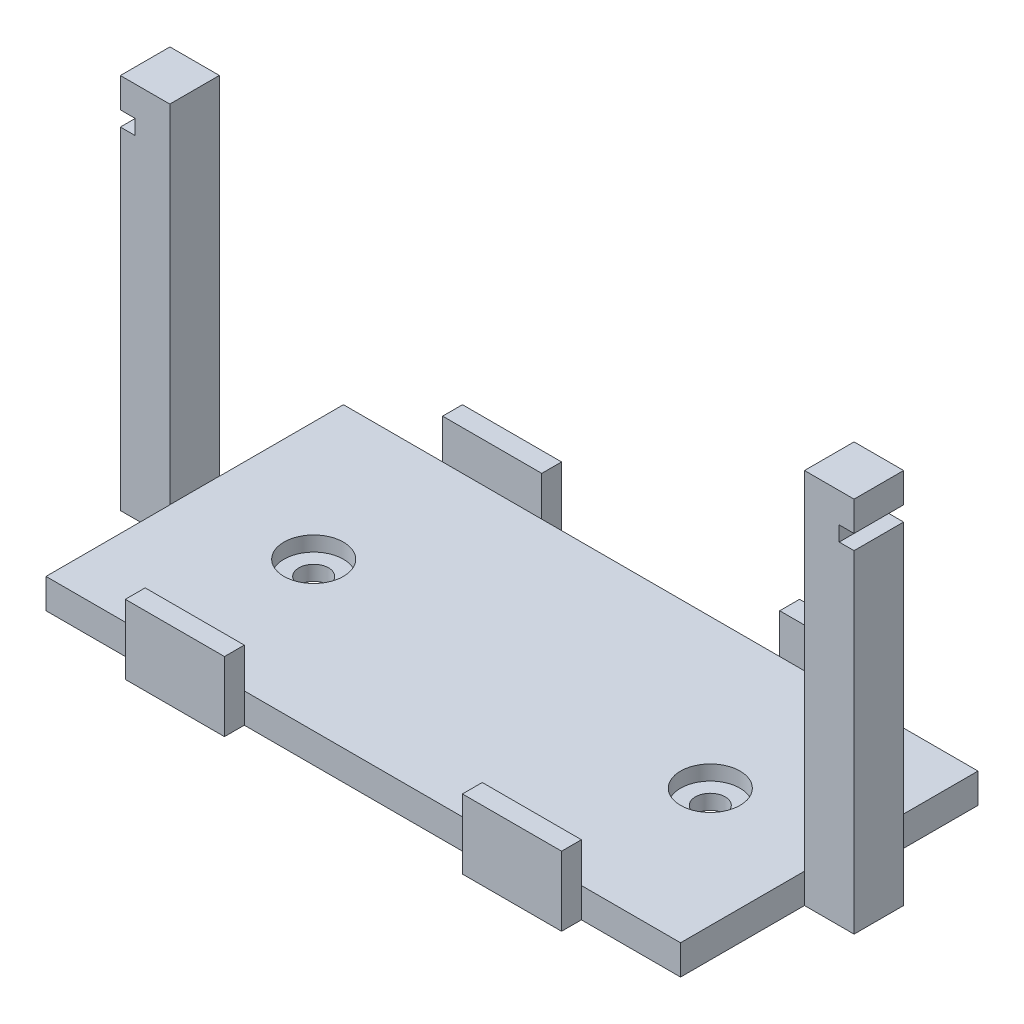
ISO-10303-21;
HEADER;
FILE_DESCRIPTION(('STEP AP214'),'2;1');
FILE_NAME('part.step','',(''),(''),'','','');
FILE_SCHEMA(('AUTOMOTIVE_DESIGN { 1 0 10303 214 1 1 1 1 }'));
ENDSEC;
DATA;
#1=APPLICATION_CONTEXT('core data for automotive mechanical design processes');
#2=APPLICATION_PROTOCOL_DEFINITION('international standard','automotive_design',2000,#1);
#3=PRODUCT_CONTEXT('',#1,'mechanical');
#4=PRODUCT('Part','Part','',(#3));
#5=PRODUCT_RELATED_PRODUCT_CATEGORY('part','',(#4));
#6=PRODUCT_DEFINITION_FORMATION('','',#4);
#7=PRODUCT_DEFINITION_CONTEXT('part definition',#1,'design');
#8=PRODUCT_DEFINITION('design','',#6,#7);
#9=PRODUCT_DEFINITION_SHAPE('','',#8);
#10=(LENGTH_UNIT() NAMED_UNIT(*) SI_UNIT(.MILLI.,.METRE.));
#11=(NAMED_UNIT(*) PLANE_ANGLE_UNIT() SI_UNIT($,.RADIAN.));
#12=(NAMED_UNIT(*) SI_UNIT($,.STERADIAN.) SOLID_ANGLE_UNIT());
#13=UNCERTAINTY_MEASURE_WITH_UNIT(LENGTH_MEASURE(1.E-05),#10,'distance_accuracy_value','');
#14=(GEOMETRIC_REPRESENTATION_CONTEXT(3) GLOBAL_UNCERTAINTY_ASSIGNED_CONTEXT((#13)) GLOBAL_UNIT_ASSIGNED_CONTEXT((#10,
#11,#12)) REPRESENTATION_CONTEXT('',''));
#15=CARTESIAN_POINT('',(0.,0.,0.));
#16=DIRECTION('',(0.,0.,1.));
#17=DIRECTION('',(1.,0.,0.));
#18=AXIS2_PLACEMENT_3D('',#15,#16,#17);
#19=CARTESIAN_POINT('',(-19.020618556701,3.,-1.43814432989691));
#20=DIRECTION('',(1.,0.,0.));
#21=DIRECTION('',(0.,0.,-1.));
#22=AXIS2_PLACEMENT_3D('',#19,#20,#21);
#23=PLANE('',#22);
#24=DIRECTION('',(0.,-1.,0.));
#25=VECTOR('',#24,1.);
#26=CARTESIAN_POINT('',(-19.020618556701,3.,-1.43814432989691));
#27=LINE('',#26,#25);
#28=CARTESIAN_POINT('',(-19.020618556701,38.,-1.43814432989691));
#29=VERTEX_POINT('',#28);
#30=CARTESIAN_POINT('',(-19.020618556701,35.,-1.43814432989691));
#31=VERTEX_POINT('',#30);
#32=EDGE_CURVE('E41',#29,#31,#27,.T.);
#33=ORIENTED_EDGE('',*,*,#32,.T.);
#34=DIRECTION('',(0.,0.,-1.));
#35=VECTOR('',#34,1.);
#36=CARTESIAN_POINT('',(-19.020618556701,35.,-1.43814432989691));
#37=LINE('',#36,#35);
#38=CARTESIAN_POINT('',(-19.020618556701,35.,3.56185567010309));
#39=VERTEX_POINT('',#38);
#40=EDGE_CURVE('E324',#39,#31,#37,.T.);
#41=ORIENTED_EDGE('',*,*,#40,.F.);
#42=DIRECTION('',(0.,-1.,0.));
#43=VECTOR('',#42,1.);
#44=CARTESIAN_POINT('',(-19.020618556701,3.,3.56185567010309));
#45=LINE('',#44,#43);
#46=CARTESIAN_POINT('',(-19.020618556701,38.,3.56185567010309));
#47=VERTEX_POINT('',#46);
#48=EDGE_CURVE('E659',#47,#39,#45,.T.);
#49=ORIENTED_EDGE('',*,*,#48,.F.);
#50=DIRECTION('',(0.,0.,1.));
#51=VECTOR('',#50,1.);
#52=CARTESIAN_POINT('',(-19.020618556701,38.,3.56185567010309));
#53=LINE('',#52,#51);
#54=EDGE_CURVE('E393',#29,#47,#53,.T.);
#55=ORIENTED_EDGE('',*,*,#54,.F.);
#56=EDGE_LOOP('',(#33,#41,#49,#55));
#57=FACE_BOUND('',#56,.T.);
#58=ADVANCED_FACE('F32',(#57),#23,.F.);
#59=CARTESIAN_POINT('',(54.979381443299,3.,3.56185567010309));
#60=DIRECTION('',(-1.,0.,0.));
#61=DIRECTION('',(0.,0.,1.));
#62=AXIS2_PLACEMENT_3D('',#59,#60,#61);
#63=PLANE('',#62);
#64=DIRECTION('',(0.,-1.,0.));
#65=VECTOR('',#64,1.);
#66=CARTESIAN_POINT('',(54.979381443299,3.,3.56185567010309));
#67=LINE('',#66,#65);
#68=CARTESIAN_POINT('',(54.979381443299,38.,3.56185567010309));
#69=VERTEX_POINT('',#68);
#70=CARTESIAN_POINT('',(54.979381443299,35.,3.56185567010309));
#71=VERTEX_POINT('',#70);
#72=EDGE_CURVE('E619',#69,#71,#67,.T.);
#73=ORIENTED_EDGE('',*,*,#72,.T.);
#74=DIRECTION('',(0.,0.,1.));
#75=VECTOR('',#74,1.);
#76=CARTESIAN_POINT('',(54.979381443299,35.,3.56185567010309));
#77=LINE('',#76,#75);
#78=CARTESIAN_POINT('',(54.979381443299,35.,-1.43814432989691));
#79=VERTEX_POINT('',#78);
#80=EDGE_CURVE('E338',#79,#71,#77,.T.);
#81=ORIENTED_EDGE('',*,*,#80,.F.);
#82=DIRECTION('',(0.,-1.,0.));
#83=VECTOR('',#82,1.);
#84=CARTESIAN_POINT('',(54.979381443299,3.,-1.43814432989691));
#85=LINE('',#84,#83);
#86=CARTESIAN_POINT('',(54.979381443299,38.,-1.43814432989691));
#87=VERTEX_POINT('',#86);
#88=EDGE_CURVE('E615',#87,#79,#85,.T.);
#89=ORIENTED_EDGE('',*,*,#88,.F.);
#90=DIRECTION('',(0.,0.,-1.));
#91=VECTOR('',#90,1.);
#92=CARTESIAN_POINT('',(54.979381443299,38.,3.56185567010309));
#93=LINE('',#92,#91);
#94=EDGE_CURVE('E379',#69,#87,#93,.T.);
#95=ORIENTED_EDGE('',*,*,#94,.F.);
#96=EDGE_LOOP('',(#73,#81,#89,#95));
#97=FACE_BOUND('',#96,.T.);
#98=ADVANCED_FACE('F836',(#97),#63,.F.);
#99=CARTESIAN_POINT('',(37.979381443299,3.,1.06185567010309));
#100=DIRECTION('',(0.,-1.,0.));
#101=DIRECTION('',(0.,0.,-1.));
#102=AXIS2_PLACEMENT_3D('',#99,#100,#101);
#103=CYLINDRICAL_SURFACE('',#102,1.5);
#104=CARTESIAN_POINT('',(37.979381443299,0.,1.06185567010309));
#105=DIRECTION('',(0.,1.,0.));
#106=DIRECTION('',(0.,0.,1.));
#107=AXIS2_PLACEMENT_3D('',#104,#105,#106);
#108=CIRCLE('',#107,1.5);
#109=CARTESIAN_POINT('',(37.979381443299,0.,2.5618556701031));
#110=VERTEX_POINT('',#109);
#111=EDGE_CURVE('E489',#110,#110,#108,.T.);
#112=ORIENTED_EDGE('',*,*,#111,.F.);
#113=EDGE_LOOP('',(#112));
#114=FACE_BOUND('',#113,.T.);
#115=CARTESIAN_POINT('',(37.979381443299,1.5,1.06185567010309));
#116=DIRECTION('',(0.,1.,0.));
#117=DIRECTION('',(0.,0.,1.));
#118=AXIS2_PLACEMENT_3D('',#115,#116,#117);
#119=CIRCLE('',#118,1.5);
#120=CARTESIAN_POINT('',(37.979381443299,1.5,2.5618556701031));
#121=VERTEX_POINT('',#120);
#122=EDGE_CURVE('E36',#121,#121,#119,.T.);
#123=ORIENTED_EDGE('',*,*,#122,.T.);
#124=EDGE_LOOP('',(#123));
#125=FACE_BOUND('',#124,.T.);
#126=ADVANCED_FACE('F868',(#114,#125),#103,.F.);
#127=CARTESIAN_POINT('',(-2.02061855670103,3.,1.06185567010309));
#128=DIRECTION('',(0.,-1.,0.));
#129=DIRECTION('',(0.,0.,-1.));
#130=AXIS2_PLACEMENT_3D('',#127,#128,#129);
#131=CYLINDRICAL_SURFACE('',#130,1.5);
#132=CARTESIAN_POINT('',(-2.02061855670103,0.,1.06185567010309));
#133=DIRECTION('',(0.,1.,0.));
#134=DIRECTION('',(0.,0.,1.));
#135=AXIS2_PLACEMENT_3D('',#132,#133,#134);
#136=CIRCLE('',#135,1.5);
#137=CARTESIAN_POINT('',(-2.02061855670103,0.,2.56185567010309));
#138=VERTEX_POINT('',#137);
#139=EDGE_CURVE('E492',#138,#138,#136,.T.);
#140=ORIENTED_EDGE('',*,*,#139,.F.);
#141=EDGE_LOOP('',(#140));
#142=FACE_BOUND('',#141,.T.);
#143=CARTESIAN_POINT('',(-2.02061855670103,1.5,1.06185567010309));
#144=DIRECTION('',(0.,1.,0.));
#145=DIRECTION('',(0.,0.,1.));
#146=AXIS2_PLACEMENT_3D('',#143,#144,#145);
#147=CIRCLE('',#146,1.5);
#148=CARTESIAN_POINT('',(-2.02061855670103,1.5,2.56185567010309));
#149=VERTEX_POINT('',#148);
#150=EDGE_CURVE('E368',#149,#149,#147,.T.);
#151=ORIENTED_EDGE('',*,*,#150,.T.);
#152=EDGE_LOOP('',(#151));
#153=FACE_BOUND('',#152,.T.);
#154=ADVANCED_FACE('F666',(#142,#153),#131,.F.);
#155=CARTESIAN_POINT('',(0.,3.,0.));
#156=DIRECTION('',(0.,-1.,0.));
#157=DIRECTION('',(0.,0.,-1.));
#158=AXIS2_PLACEMENT_3D('',#155,#156,#157);
#159=PLANE('',#158);
#160=CARTESIAN_POINT('',(37.979381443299,3.,1.06185567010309));
#161=DIRECTION('',(0.,1.,0.));
#162=DIRECTION('',(0.,0.,1.));
#163=AXIS2_PLACEMENT_3D('',#160,#161,#162);
#164=CIRCLE('',#163,3.);
#165=CARTESIAN_POINT('',(37.979381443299,3.,4.06185567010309));
#166=VERTEX_POINT('',#165);
#167=EDGE_CURVE('E353',#166,#166,#164,.T.);
#168=ORIENTED_EDGE('',*,*,#167,.F.);
#169=EDGE_LOOP('',(#168));
#170=FACE_BOUND('',#169,.T.);
#171=CARTESIAN_POINT('',(-2.02061855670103,3.,1.06185567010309));
#172=DIRECTION('',(0.,1.,0.));
#173=DIRECTION('',(0.,0.,1.));
#174=AXIS2_PLACEMENT_3D('',#171,#172,#173);
#175=CIRCLE('',#174,3.);
#176=CARTESIAN_POINT('',(-2.02061855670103,3.,4.06185567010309));
#177=VERTEX_POINT('',#176);
#178=EDGE_CURVE('E369',#177,#177,#175,.T.);
#179=ORIENTED_EDGE('',*,*,#178,.F.);
#180=EDGE_LOOP('',(#179));
#181=FACE_BOUND('',#180,.T.);
#182=DIRECTION('',(0.,0.,1.));
#183=VECTOR('',#182,1.);
#184=CARTESIAN_POINT('',(49.979381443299,3.,3.56185567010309));
#185=LINE('',#184,#183);
#186=CARTESIAN_POINT('',(49.979381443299,3.,-1.43814432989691));
#187=VERTEX_POINT('',#186);
#188=CARTESIAN_POINT('',(49.979381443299,3.,3.56185567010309));
#189=VERTEX_POINT('',#188);
#190=EDGE_CURVE('E376',#187,#189,#185,.T.);
#191=ORIENTED_EDGE('',*,*,#190,.F.);
#192=DIRECTION('',(0.,0.,-1.));
#193=VECTOR('',#192,1.);
#194=CARTESIAN_POINT('',(49.979381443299,3.,-13.9381443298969));
#195=LINE('',#194,#193);
#196=CARTESIAN_POINT('',(49.979381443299,3.,-13.9381443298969));
#197=VERTEX_POINT('',#196);
#198=EDGE_CURVE('E514',#187,#197,#195,.T.);
#199=ORIENTED_EDGE('',*,*,#198,.T.);
#200=DIRECTION('',(-1.,0.,0.));
#201=VECTOR('',#200,1.);
#202=CARTESIAN_POINT('',(39.979381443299,3.,-13.9381443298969));
#203=LINE('',#202,#201);
#204=CARTESIAN_POINT('',(39.979381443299,3.,-13.9381443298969));
#205=VERTEX_POINT('',#204);
#206=EDGE_CURVE('E516',#197,#205,#203,.T.);
#207=ORIENTED_EDGE('',*,*,#206,.T.);
#208=DIRECTION('',(1.,0.,0.));
#209=VECTOR('',#208,1.);
#210=CARTESIAN_POINT('',(29.979381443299,3.,-13.9381443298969));
#211=LINE('',#210,#209);
#212=CARTESIAN_POINT('',(29.979381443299,3.,-13.9381443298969));
#213=VERTEX_POINT('',#212);
#214=EDGE_CURVE('E449',#213,#205,#211,.T.);
#215=ORIENTED_EDGE('',*,*,#214,.F.);
#216=DIRECTION('',(-1.,0.,0.));
#217=VECTOR('',#216,1.);
#218=CARTESIAN_POINT('',(5.97938144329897,3.,-13.9381443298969));
#219=LINE('',#218,#217);
#220=CARTESIAN_POINT('',(5.97938144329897,3.,-13.9381443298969));
#221=VERTEX_POINT('',#220);
#222=EDGE_CURVE('E518',#213,#221,#219,.T.);
#223=ORIENTED_EDGE('',*,*,#222,.T.);
#224=DIRECTION('',(1.,0.,0.));
#225=VECTOR('',#224,1.);
#226=CARTESIAN_POINT('',(-4.02061855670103,3.,-13.9381443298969));
#227=LINE('',#226,#225);
#228=CARTESIAN_POINT('',(-4.02061855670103,3.,-13.9381443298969));
#229=VERTEX_POINT('',#228);
#230=EDGE_CURVE('E469',#229,#221,#227,.T.);
#231=ORIENTED_EDGE('',*,*,#230,.F.);
#232=DIRECTION('',(-1.,0.,0.));
#233=VECTOR('',#232,1.);
#234=CARTESIAN_POINT('',(-14.020618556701,3.,-13.9381443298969));
#235=LINE('',#234,#233);
#236=CARTESIAN_POINT('',(-14.020618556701,3.,-13.9381443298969));
#237=VERTEX_POINT('',#236);
#238=EDGE_CURVE('E521',#229,#237,#235,.T.);
#239=ORIENTED_EDGE('',*,*,#238,.T.);
#240=DIRECTION('',(0.,0.,1.));
#241=VECTOR('',#240,1.);
#242=CARTESIAN_POINT('',(-14.020618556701,3.,-13.9381443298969));
#243=LINE('',#242,#241);
#244=CARTESIAN_POINT('',(-14.020618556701,3.,-1.43814432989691));
#245=VERTEX_POINT('',#244);
#246=EDGE_CURVE('E496',#237,#245,#243,.T.);
#247=ORIENTED_EDGE('',*,*,#246,.T.);
#248=DIRECTION('',(-1.,0.,0.));
#249=VECTOR('',#248,1.);
#250=CARTESIAN_POINT('',(-14.020618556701,3.,-1.43814432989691));
#251=LINE('',#250,#249);
#252=CARTESIAN_POINT('',(-14.0344082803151,3.,-1.43814432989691));
#253=VERTEX_POINT('',#252);
#254=EDGE_CURVE('E499',#245,#253,#251,.T.);
#255=ORIENTED_EDGE('',*,*,#254,.T.);
#256=DIRECTION('',(0.,0.,-1.));
#257=VECTOR('',#256,1.);
#258=CARTESIAN_POINT('',(-14.0344082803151,3.,3.56185567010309));
#259=LINE('',#258,#257);
#260=CARTESIAN_POINT('',(-14.0344082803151,3.,3.56185567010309));
#261=VERTEX_POINT('',#260);
#262=EDGE_CURVE('E392',#261,#253,#259,.T.);
#263=ORIENTED_EDGE('',*,*,#262,.F.);
#264=DIRECTION('',(1.,0.,0.));
#265=VECTOR('',#264,1.);
#266=CARTESIAN_POINT('',(-14.020618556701,3.,3.56185567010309));
#267=LINE('',#266,#265);
#268=CARTESIAN_POINT('',(-14.020618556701,3.,3.56185567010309));
#269=VERTEX_POINT('',#268);
#270=EDGE_CURVE('E502',#261,#269,#267,.T.);
#271=ORIENTED_EDGE('',*,*,#270,.T.);
#272=DIRECTION('',(0.,0.,1.));
#273=VECTOR('',#272,1.);
#274=CARTESIAN_POINT('',(-14.020618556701,3.,3.56185567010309));
#275=LINE('',#274,#273);
#276=CARTESIAN_POINT('',(-14.020618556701,3.,16.0618556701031));
#277=VERTEX_POINT('',#276);
#278=EDGE_CURVE('E504',#269,#277,#275,.T.);
#279=ORIENTED_EDGE('',*,*,#278,.T.);
#280=DIRECTION('',(1.,0.,0.));
#281=VECTOR('',#280,1.);
#282=CARTESIAN_POINT('',(-14.020618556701,3.,16.0618556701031));
#283=LINE('',#282,#281);
#284=CARTESIAN_POINT('',(-4.02061855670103,3.,16.0618556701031));
#285=VERTEX_POINT('',#284);
#286=EDGE_CURVE('E506',#277,#285,#283,.T.);
#287=ORIENTED_EDGE('',*,*,#286,.T.);
#288=DIRECTION('',(-1.,0.,0.));
#289=VECTOR('',#288,1.);
#290=CARTESIAN_POINT('',(-4.02061855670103,3.,16.0618556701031));
#291=LINE('',#290,#289);
#292=CARTESIAN_POINT('',(5.97938144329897,3.,16.0618556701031));
#293=VERTEX_POINT('',#292);
#294=EDGE_CURVE('E430',#293,#285,#291,.T.);
#295=ORIENTED_EDGE('',*,*,#294,.F.);
#296=DIRECTION('',(1.,0.,0.));
#297=VECTOR('',#296,1.);
#298=CARTESIAN_POINT('',(5.97938144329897,3.,16.0618556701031));
#299=LINE('',#298,#297);
#300=CARTESIAN_POINT('',(29.979381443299,3.,16.0618556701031));
#301=VERTEX_POINT('',#300);
#302=EDGE_CURVE('E508',#293,#301,#299,.T.);
#303=ORIENTED_EDGE('',*,*,#302,.T.);
#304=DIRECTION('',(-1.,0.,0.));
#305=VECTOR('',#304,1.);
#306=CARTESIAN_POINT('',(29.979381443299,3.,16.0618556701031));
#307=LINE('',#306,#305);
#308=CARTESIAN_POINT('',(39.979381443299,3.,16.0618556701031));
#309=VERTEX_POINT('',#308);
#310=EDGE_CURVE('E411',#309,#301,#307,.T.);
#311=ORIENTED_EDGE('',*,*,#310,.F.);
#312=DIRECTION('',(1.,0.,0.));
#313=VECTOR('',#312,1.);
#314=CARTESIAN_POINT('',(39.979381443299,3.,16.0618556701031));
#315=LINE('',#314,#313);
#316=CARTESIAN_POINT('',(49.979381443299,3.,16.0618556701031));
#317=VERTEX_POINT('',#316);
#318=EDGE_CURVE('E510',#309,#317,#315,.T.);
#319=ORIENTED_EDGE('',*,*,#318,.T.);
#320=DIRECTION('',(0.,0.,-1.));
#321=VECTOR('',#320,1.);
#322=CARTESIAN_POINT('',(49.979381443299,3.,3.56185567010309));
#323=LINE('',#322,#321);
#324=EDGE_CURVE('E512',#317,#189,#323,.T.);
#325=ORIENTED_EDGE('',*,*,#324,.T.);
#326=EDGE_LOOP('',(#191,#199,#207,#215,#223,#231,#239,#247,#255,#263,#271,#279,#287,#295,#303,
#311,#319,#325));
#327=FACE_BOUND('',#326,.T.);
#328=ADVANCED_FACE('F682',(#170,#181,#327),#159,.F.);
#329=CARTESIAN_POINT('',(0.,0.,0.));
#330=DIRECTION('',(0.,-1.,0.));
#331=DIRECTION('',(0.,0.,-1.));
#332=AXIS2_PLACEMENT_3D('',#329,#330,#331);
#333=PLANE('',#332);
#334=ORIENTED_EDGE('',*,*,#139,.T.);
#335=EDGE_LOOP('',(#334));
#336=FACE_BOUND('',#335,.T.);
#337=DIRECTION('',(0.,0.,1.));
#338=VECTOR('',#337,1.);
#339=CARTESIAN_POINT('',(-14.020618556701,0.,-13.9381443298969));
#340=LINE('',#339,#338);
#341=CARTESIAN_POINT('',(-14.020618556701,0.,-13.9381443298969));
#342=VERTEX_POINT('',#341);
#343=CARTESIAN_POINT('',(-14.020618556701,0.,-1.43814432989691));
#344=VERTEX_POINT('',#343);
#345=EDGE_CURVE('E495',#342,#344,#340,.T.);
#346=ORIENTED_EDGE('',*,*,#345,.F.);
#347=DIRECTION('',(-1.,0.,0.));
#348=VECTOR('',#347,1.);
#349=CARTESIAN_POINT('',(-14.020618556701,0.,-13.9381443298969));
#350=LINE('',#349,#348);
#351=CARTESIAN_POINT('',(-4.02061855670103,0.,-13.9381443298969));
#352=VERTEX_POINT('',#351);
#353=EDGE_CURVE('E500',#352,#342,#350,.T.);
#354=ORIENTED_EDGE('',*,*,#353,.F.);
#355=DIRECTION('',(0.,0.,1.));
#356=VECTOR('',#355,1.);
#357=CARTESIAN_POINT('',(-4.02061855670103,0.,-15.9381443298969));
#358=LINE('',#357,#356);
#359=CARTESIAN_POINT('',(-4.02061855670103,0.,-15.9381443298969));
#360=VERTEX_POINT('',#359);
#361=EDGE_CURVE('E579',#360,#352,#358,.T.);
#362=ORIENTED_EDGE('',*,*,#361,.F.);
#363=DIRECTION('',(-1.,0.,0.));
#364=VECTOR('',#363,1.);
#365=CARTESIAN_POINT('',(5.97938144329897,0.,-15.9381443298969));
#366=LINE('',#365,#364);
#367=CARTESIAN_POINT('',(5.97938144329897,0.,-15.9381443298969));
#368=VERTEX_POINT('',#367);
#369=EDGE_CURVE('E577',#368,#360,#366,.T.);
#370=ORIENTED_EDGE('',*,*,#369,.F.);
#371=DIRECTION('',(0.,0.,-1.));
#372=VECTOR('',#371,1.);
#373=CARTESIAN_POINT('',(5.97938144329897,0.,-15.9381443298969));
#374=LINE('',#373,#372);
#375=CARTESIAN_POINT('',(5.97938144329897,0.,-13.9381443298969));
#376=VERTEX_POINT('',#375);
#377=EDGE_CURVE('E575',#376,#368,#374,.T.);
#378=ORIENTED_EDGE('',*,*,#377,.F.);
#379=DIRECTION('',(-1.,0.,0.));
#380=VECTOR('',#379,1.);
#381=CARTESIAN_POINT('',(5.97938144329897,0.,-13.9381443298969));
#382=LINE('',#381,#380);
#383=CARTESIAN_POINT('',(29.979381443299,0.,-13.9381443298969));
#384=VERTEX_POINT('',#383);
#385=EDGE_CURVE('E573',#384,#376,#382,.T.);
#386=ORIENTED_EDGE('',*,*,#385,.F.);
#387=DIRECTION('',(0.,0.,1.));
#388=VECTOR('',#387,1.);
#389=CARTESIAN_POINT('',(29.979381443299,0.,-15.9381443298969));
#390=LINE('',#389,#388);
#391=CARTESIAN_POINT('',(29.979381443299,0.,-15.9381443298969));
#392=VERTEX_POINT('',#391);
#393=EDGE_CURVE('E571',#392,#384,#390,.T.);
#394=ORIENTED_EDGE('',*,*,#393,.F.);
#395=DIRECTION('',(-1.,0.,0.));
#396=VECTOR('',#395,1.);
#397=CARTESIAN_POINT('',(39.979381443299,0.,-15.9381443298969));
#398=LINE('',#397,#396);
#399=CARTESIAN_POINT('',(39.979381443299,0.,-15.9381443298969));
#400=VERTEX_POINT('',#399);
#401=EDGE_CURVE('E569',#400,#392,#398,.T.);
#402=ORIENTED_EDGE('',*,*,#401,.F.);
#403=DIRECTION('',(0.,0.,-1.));
#404=VECTOR('',#403,1.);
#405=CARTESIAN_POINT('',(39.979381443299,0.,-15.9381443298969));
#406=LINE('',#405,#404);
#407=CARTESIAN_POINT('',(39.979381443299,0.,-13.9381443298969));
#408=VERTEX_POINT('',#407);
#409=EDGE_CURVE('E567',#408,#400,#406,.T.);
#410=ORIENTED_EDGE('',*,*,#409,.F.);
#411=DIRECTION('',(-1.,0.,0.));
#412=VECTOR('',#411,1.);
#413=CARTESIAN_POINT('',(39.979381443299,0.,-13.9381443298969));
#414=LINE('',#413,#412);
#415=CARTESIAN_POINT('',(49.979381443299,0.,-13.9381443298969));
#416=VERTEX_POINT('',#415);
#417=EDGE_CURVE('E565',#416,#408,#414,.T.);
#418=ORIENTED_EDGE('',*,*,#417,.F.);
#419=DIRECTION('',(0.,0.,-1.));
#420=VECTOR('',#419,1.);
#421=CARTESIAN_POINT('',(49.979381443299,0.,-13.9381443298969));
#422=LINE('',#421,#420);
#423=CARTESIAN_POINT('',(49.979381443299,0.,-1.43814432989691));
#424=VERTEX_POINT('',#423);
#425=EDGE_CURVE('E563',#424,#416,#422,.T.);
#426=ORIENTED_EDGE('',*,*,#425,.F.);
#427=DIRECTION('',(-1.,0.,0.));
#428=VECTOR('',#427,1.);
#429=CARTESIAN_POINT('',(54.979381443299,0.,-1.43814432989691));
#430=LINE('',#429,#428);
#431=CARTESIAN_POINT('',(54.979381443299,0.,-1.43814432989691));
#432=VERTEX_POINT('',#431);
#433=EDGE_CURVE('E561',#432,#424,#430,.T.);
#434=ORIENTED_EDGE('',*,*,#433,.F.);
#435=DIRECTION('',(0.,0.,-1.));
#436=VECTOR('',#435,1.);
#437=CARTESIAN_POINT('',(54.979381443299,0.,3.56185567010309));
#438=LINE('',#437,#436);
#439=CARTESIAN_POINT('',(54.979381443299,0.,3.56185567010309));
#440=VERTEX_POINT('',#439);
#441=EDGE_CURVE('E558',#440,#432,#438,.T.);
#442=ORIENTED_EDGE('',*,*,#441,.F.);
#443=DIRECTION('',(1.,0.,0.));
#444=VECTOR('',#443,1.);
#445=CARTESIAN_POINT('',(54.979381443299,0.,3.56185567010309));
#446=LINE('',#445,#444);
#447=CARTESIAN_POINT('',(49.979381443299,0.,3.56185567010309));
#448=VERTEX_POINT('',#447);
#449=EDGE_CURVE('E555',#448,#440,#446,.T.);
#450=ORIENTED_EDGE('',*,*,#449,.F.);
#451=DIRECTION('',(0.,0.,-1.));
#452=VECTOR('',#451,1.);
#453=CARTESIAN_POINT('',(49.979381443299,0.,3.56185567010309));
#454=LINE('',#453,#452);
#455=CARTESIAN_POINT('',(49.979381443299,0.,16.0618556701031));
#456=VERTEX_POINT('',#455);
#457=EDGE_CURVE('E553',#456,#448,#454,.T.);
#458=ORIENTED_EDGE('',*,*,#457,.F.);
#459=DIRECTION('',(1.,0.,0.));
#460=VECTOR('',#459,1.);
#461=CARTESIAN_POINT('',(39.979381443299,0.,16.0618556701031));
#462=LINE('',#461,#460);
#463=CARTESIAN_POINT('',(39.979381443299,0.,16.0618556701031));
#464=VERTEX_POINT('',#463);
#465=EDGE_CURVE('E551',#464,#456,#462,.T.);
#466=ORIENTED_EDGE('',*,*,#465,.F.);
#467=DIRECTION('',(0.,0.,-1.));
#468=VECTOR('',#467,1.);
#469=CARTESIAN_POINT('',(39.979381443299,0.,16.0618556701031));
#470=LINE('',#469,#468);
#471=CARTESIAN_POINT('',(39.979381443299,0.,18.0618556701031));
#472=VERTEX_POINT('',#471);
#473=EDGE_CURVE('E549',#472,#464,#470,.T.);
#474=ORIENTED_EDGE('',*,*,#473,.F.);
#475=DIRECTION('',(1.,0.,0.));
#476=VECTOR('',#475,1.);
#477=CARTESIAN_POINT('',(29.979381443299,0.,18.0618556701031));
#478=LINE('',#477,#476);
#479=CARTESIAN_POINT('',(29.979381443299,0.,18.0618556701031));
#480=VERTEX_POINT('',#479);
#481=EDGE_CURVE('E547',#480,#472,#478,.T.);
#482=ORIENTED_EDGE('',*,*,#481,.F.);
#483=DIRECTION('',(0.,0.,1.));
#484=VECTOR('',#483,1.);
#485=CARTESIAN_POINT('',(29.979381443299,0.,16.0618556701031));
#486=LINE('',#485,#484);
#487=CARTESIAN_POINT('',(29.979381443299,0.,16.0618556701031));
#488=VERTEX_POINT('',#487);
#489=EDGE_CURVE('E545',#488,#480,#486,.T.);
#490=ORIENTED_EDGE('',*,*,#489,.F.);
#491=DIRECTION('',(1.,0.,0.));
#492=VECTOR('',#491,1.);
#493=CARTESIAN_POINT('',(5.97938144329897,0.,16.0618556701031));
#494=LINE('',#493,#492);
#495=CARTESIAN_POINT('',(5.97938144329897,0.,16.0618556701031));
#496=VERTEX_POINT('',#495);
#497=EDGE_CURVE('E543',#496,#488,#494,.T.);
#498=ORIENTED_EDGE('',*,*,#497,.F.);
#499=DIRECTION('',(0.,0.,-1.));
#500=VECTOR('',#499,1.);
#501=CARTESIAN_POINT('',(5.97938144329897,0.,16.0618556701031));
#502=LINE('',#501,#500);
#503=CARTESIAN_POINT('',(5.97938144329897,0.,18.0618556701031));
#504=VERTEX_POINT('',#503);
#505=EDGE_CURVE('E541',#504,#496,#502,.T.);
#506=ORIENTED_EDGE('',*,*,#505,.F.);
#507=DIRECTION('',(1.,0.,0.));
#508=VECTOR('',#507,1.);
#509=CARTESIAN_POINT('',(-4.02061855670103,0.,18.0618556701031));
#510=LINE('',#509,#508);
#511=CARTESIAN_POINT('',(-4.02061855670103,0.,18.0618556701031));
#512=VERTEX_POINT('',#511);
#513=EDGE_CURVE('E539',#512,#504,#510,.T.);
#514=ORIENTED_EDGE('',*,*,#513,.F.);
#515=DIRECTION('',(0.,0.,1.));
#516=VECTOR('',#515,1.);
#517=CARTESIAN_POINT('',(-4.02061855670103,0.,16.0618556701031));
#518=LINE('',#517,#516);
#519=CARTESIAN_POINT('',(-4.02061855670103,0.,16.0618556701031));
#520=VERTEX_POINT('',#519);
#521=EDGE_CURVE('E537',#520,#512,#518,.T.);
#522=ORIENTED_EDGE('',*,*,#521,.F.);
#523=DIRECTION('',(1.,0.,0.));
#524=VECTOR('',#523,1.);
#525=CARTESIAN_POINT('',(-14.020618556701,0.,16.0618556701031));
#526=LINE('',#525,#524);
#527=CARTESIAN_POINT('',(-14.020618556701,0.,16.0618556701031));
#528=VERTEX_POINT('',#527);
#529=EDGE_CURVE('E535',#528,#520,#526,.T.);
#530=ORIENTED_EDGE('',*,*,#529,.F.);
#531=DIRECTION('',(0.,0.,1.));
#532=VECTOR('',#531,1.);
#533=CARTESIAN_POINT('',(-14.020618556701,0.,3.56185567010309));
#534=LINE('',#533,#532);
#535=CARTESIAN_POINT('',(-14.020618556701,0.,3.56185567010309));
#536=VERTEX_POINT('',#535);
#537=EDGE_CURVE('E533',#536,#528,#534,.T.);
#538=ORIENTED_EDGE('',*,*,#537,.F.);
#539=DIRECTION('',(1.,0.,0.));
#540=VECTOR('',#539,1.);
#541=CARTESIAN_POINT('',(-14.020618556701,0.,3.56185567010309));
#542=LINE('',#541,#540);
#543=CARTESIAN_POINT('',(-19.020618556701,0.,3.56185567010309));
#544=VERTEX_POINT('',#543);
#545=EDGE_CURVE('E531',#544,#536,#542,.T.);
#546=ORIENTED_EDGE('',*,*,#545,.F.);
#547=DIRECTION('',(0.,0.,1.));
#548=VECTOR('',#547,1.);
#549=CARTESIAN_POINT('',(-19.020618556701,0.,-1.43814432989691));
#550=LINE('',#549,#548);
#551=CARTESIAN_POINT('',(-19.020618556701,0.,-1.43814432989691));
#552=VERTEX_POINT('',#551);
#553=EDGE_CURVE('E528',#552,#544,#550,.T.);
#554=ORIENTED_EDGE('',*,*,#553,.F.);
#555=DIRECTION('',(-1.,0.,0.));
#556=VECTOR('',#555,1.);
#557=CARTESIAN_POINT('',(-14.020618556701,0.,-1.43814432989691));
#558=LINE('',#557,#556);
#559=EDGE_CURVE('E526',#344,#552,#558,.T.);
#560=ORIENTED_EDGE('',*,*,#559,.F.);
#561=EDGE_LOOP('',(#346,#354,#362,#370,#378,#386,#394,#402,#410,#418,#426,#434,#442,#450,#458,
#466,#474,#482,#490,#498,#506,#514,#522,#530,#538,#546,#554,#560));
#562=FACE_BOUND('',#561,.T.);
#563=ORIENTED_EDGE('',*,*,#111,.T.);
#564=EDGE_LOOP('',(#563));
#565=FACE_BOUND('',#564,.T.);
#566=ADVANCED_FACE('F685',(#336,#562,#565),#333,.T.);
#567=CARTESIAN_POINT('',(-14.020618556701,3.,-13.9381443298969));
#568=DIRECTION('',(1.,0.,0.));
#569=DIRECTION('',(0.,0.,-1.));
#570=AXIS2_PLACEMENT_3D('',#567,#568,#569);
#571=PLANE('',#570);
#572=ORIENTED_EDGE('',*,*,#345,.T.);
#573=DIRECTION('',(0.,-1.,0.));
#574=VECTOR('',#573,1.);
#575=CARTESIAN_POINT('',(-14.020618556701,3.,-1.43814432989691));
#576=LINE('',#575,#574);
#577=EDGE_CURVE('E11',#245,#344,#576,.T.);
#578=ORIENTED_EDGE('',*,*,#577,.F.);
#579=ORIENTED_EDGE('',*,*,#246,.F.);
#580=DIRECTION('',(0.,-1.,0.));
#581=VECTOR('',#580,1.);
#582=CARTESIAN_POINT('',(-14.020618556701,3.,-13.9381443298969));
#583=LINE('',#582,#581);
#584=EDGE_CURVE('E523',#237,#342,#583,.T.);
#585=ORIENTED_EDGE('',*,*,#584,.T.);
#586=EDGE_LOOP('',(#572,#578,#579,#585));
#587=FACE_BOUND('',#586,.T.);
#588=ADVANCED_FACE('F34',(#587),#571,.F.);
#589=CARTESIAN_POINT('',(-14.020618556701,3.,-1.43814432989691));
#590=DIRECTION('',(0.,0.,1.));
#591=DIRECTION('',(1.,0.,0.));
#592=AXIS2_PLACEMENT_3D('',#589,#590,#591);
#593=PLANE('',#592);
#594=DIRECTION('',(0.,-1.,0.));
#595=VECTOR('',#594,1.);
#596=CARTESIAN_POINT('',(-17.520618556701,35.,-1.43814432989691));
#597=LINE('',#596,#595);
#598=CARTESIAN_POINT('',(-17.520618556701,35.,-1.43814432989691));
#599=VERTEX_POINT('',#598);
#600=CARTESIAN_POINT('',(-17.520618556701,33.5,-1.43814432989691));
#601=VERTEX_POINT('',#600);
#602=EDGE_CURVE('E315',#599,#601,#597,.T.);
#603=ORIENTED_EDGE('',*,*,#602,.F.);
#604=DIRECTION('',(-1.,0.,0.));
#605=VECTOR('',#604,1.);
#606=CARTESIAN_POINT('',(-17.520618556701,35.,-1.43814432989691));
#607=LINE('',#606,#605);
#608=EDGE_CURVE('E348',#599,#31,#607,.T.);
#609=ORIENTED_EDGE('',*,*,#608,.T.);
#610=ORIENTED_EDGE('',*,*,#32,.F.);
#611=DIRECTION('',(-1.,0.,0.));
#612=VECTOR('',#611,1.);
#613=CARTESIAN_POINT('',(-19.020618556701,38.,-1.43814432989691));
#614=LINE('',#613,#612);
#615=CARTESIAN_POINT('',(-14.0344082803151,38.,-1.43814432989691));
#616=VERTEX_POINT('',#615);
#617=EDGE_CURVE('E400',#616,#29,#614,.T.);
#618=ORIENTED_EDGE('',*,*,#617,.F.);
#619=DIRECTION('',(0.,-1.,0.));
#620=VECTOR('',#619,1.);
#621=CARTESIAN_POINT('',(-14.0344082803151,38.,-1.43814432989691));
#622=LINE('',#621,#620);
#623=EDGE_CURVE('E403',#616,#253,#622,.T.);
#624=ORIENTED_EDGE('',*,*,#623,.T.);
#625=ORIENTED_EDGE('',*,*,#254,.F.);
#626=ORIENTED_EDGE('',*,*,#577,.T.);
#627=ORIENTED_EDGE('',*,*,#559,.T.);
#628=CARTESIAN_POINT('',(-19.020618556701,33.5,-1.43814432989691));
#629=VERTEX_POINT('',#628);
#630=EDGE_CURVE('E329',#629,#552,#27,.T.);
#631=ORIENTED_EDGE('',*,*,#630,.F.);
#632=DIRECTION('',(-1.,0.,0.));
#633=VECTOR('',#632,1.);
#634=CARTESIAN_POINT('',(-17.520618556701,33.5,-1.43814432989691));
#635=LINE('',#634,#633);
#636=EDGE_CURVE('E309',#601,#629,#635,.T.);
#637=ORIENTED_EDGE('',*,*,#636,.F.);
#638=EDGE_LOOP('',(#603,#609,#610,#618,#624,#625,#626,#627,#631,#637));
#639=FACE_BOUND('',#638,.T.);
#640=ADVANCED_FACE('F327',(#639),#593,.F.);
#641=CARTESIAN_POINT('',(-19.020618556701,33.5,3.56185567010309));
#642=VERTEX_POINT('',#641);
#643=EDGE_CURVE('E658',#642,#544,#45,.T.);
#644=ORIENTED_EDGE('',*,*,#643,.F.);
#645=DIRECTION('',(0.,0.,1.));
#646=VECTOR('',#645,1.);
#647=CARTESIAN_POINT('',(-19.020618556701,33.5,-1.43814432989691));
#648=LINE('',#647,#646);
#649=EDGE_CURVE('E878',#629,#642,#648,.T.);
#650=ORIENTED_EDGE('',*,*,#649,.F.);
#651=ORIENTED_EDGE('',*,*,#630,.T.);
#652=ORIENTED_EDGE('',*,*,#553,.T.);
#653=EDGE_LOOP('',(#644,#650,#651,#652));
#654=FACE_BOUND('',#653,.T.);
#655=ADVANCED_FACE('F864',(#654),#23,.F.);
#656=CARTESIAN_POINT('',(-14.020618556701,3.,3.56185567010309));
#657=DIRECTION('',(0.,0.,-1.));
#658=DIRECTION('',(-1.,0.,0.));
#659=AXIS2_PLACEMENT_3D('',#656,#657,#658);
#660=PLANE('',#659);
#661=ORIENTED_EDGE('',*,*,#48,.T.);
#662=DIRECTION('',(-1.,0.,0.));
#663=VECTOR('',#662,1.);
#664=CARTESIAN_POINT('',(-17.520618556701,35.,3.56185567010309));
#665=LINE('',#664,#663);
#666=CARTESIAN_POINT('',(-17.520618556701,35.,3.56185567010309));
#667=VERTEX_POINT('',#666);
#668=EDGE_CURVE('E331',#667,#39,#665,.T.);
#669=ORIENTED_EDGE('',*,*,#668,.F.);
#670=DIRECTION('',(0.,1.,0.));
#671=VECTOR('',#670,1.);
#672=CARTESIAN_POINT('',(-17.520618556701,35.,3.56185567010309));
#673=LINE('',#672,#671);
#674=CARTESIAN_POINT('',(-17.520618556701,33.5,3.56185567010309));
#675=VERTEX_POINT('',#674);
#676=EDGE_CURVE('E314',#675,#667,#673,.T.);
#677=ORIENTED_EDGE('',*,*,#676,.F.);
#678=DIRECTION('',(-1.,0.,0.));
#679=VECTOR('',#678,1.);
#680=CARTESIAN_POINT('',(-17.520618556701,33.5,3.56185567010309));
#681=LINE('',#680,#679);
#682=EDGE_CURVE('E312',#675,#642,#681,.T.);
#683=ORIENTED_EDGE('',*,*,#682,.T.);
#684=ORIENTED_EDGE('',*,*,#643,.T.);
#685=ORIENTED_EDGE('',*,*,#545,.T.);
#686=DIRECTION('',(0.,-1.,0.));
#687=VECTOR('',#686,1.);
#688=CARTESIAN_POINT('',(-14.020618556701,3.,3.56185567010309));
#689=LINE('',#688,#687);
#690=EDGE_CURVE('E655',#269,#536,#689,.T.);
#691=ORIENTED_EDGE('',*,*,#690,.F.);
#692=ORIENTED_EDGE('',*,*,#270,.F.);
#693=DIRECTION('',(0.,-1.,0.));
#694=VECTOR('',#693,1.);
#695=CARTESIAN_POINT('',(-14.0344082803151,38.,3.56185567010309));
#696=LINE('',#695,#694);
#697=CARTESIAN_POINT('',(-14.0344082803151,38.,3.56185567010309));
#698=VERTEX_POINT('',#697);
#699=EDGE_CURVE('E408',#698,#261,#696,.T.);
#700=ORIENTED_EDGE('',*,*,#699,.F.);
#701=DIRECTION('',(1.,0.,0.));
#702=VECTOR('',#701,1.);
#703=CARTESIAN_POINT('',(-19.020618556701,38.,3.56185567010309));
#704=LINE('',#703,#702);
#705=EDGE_CURVE('E396',#47,#698,#704,.T.);
#706=ORIENTED_EDGE('',*,*,#705,.F.);
#707=EDGE_LOOP('',(#661,#669,#677,#683,#684,#685,#691,#692,#700,#706));
#708=FACE_BOUND('',#707,.T.);
#709=ADVANCED_FACE('F768',(#708),#660,.F.);
#710=CARTESIAN_POINT('',(-14.020618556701,3.,3.56185567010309));
#711=DIRECTION('',(1.,0.,0.));
#712=DIRECTION('',(0.,0.,-1.));
#713=AXIS2_PLACEMENT_3D('',#710,#711,#712);
#714=PLANE('',#713);
#715=ORIENTED_EDGE('',*,*,#537,.T.);
#716=DIRECTION('',(0.,-1.,0.));
#717=VECTOR('',#716,1.);
#718=CARTESIAN_POINT('',(-14.020618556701,3.,16.0618556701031));
#719=LINE('',#718,#717);
#720=EDGE_CURVE('E652',#277,#528,#719,.T.);
#721=ORIENTED_EDGE('',*,*,#720,.F.);
#722=ORIENTED_EDGE('',*,*,#278,.F.);
#723=ORIENTED_EDGE('',*,*,#690,.T.);
#724=EDGE_LOOP('',(#715,#721,#722,#723));
#725=FACE_BOUND('',#724,.T.);
#726=ADVANCED_FACE('F776',(#725),#714,.F.);
#727=CARTESIAN_POINT('',(-14.020618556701,3.,16.0618556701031));
#728=DIRECTION('',(0.,0.,-1.));
#729=DIRECTION('',(-1.,0.,0.));
#730=AXIS2_PLACEMENT_3D('',#727,#728,#729);
#731=PLANE('',#730);
#732=ORIENTED_EDGE('',*,*,#529,.T.);
#733=DIRECTION('',(0.,-1.,0.));
#734=VECTOR('',#733,1.);
#735=CARTESIAN_POINT('',(-4.02061855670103,3.,16.0618556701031));
#736=LINE('',#735,#734);
#737=EDGE_CURVE('E649',#285,#520,#736,.T.);
#738=ORIENTED_EDGE('',*,*,#737,.F.);
#739=ORIENTED_EDGE('',*,*,#286,.F.);
#740=ORIENTED_EDGE('',*,*,#720,.T.);
#741=EDGE_LOOP('',(#732,#738,#739,#740));
#742=FACE_BOUND('',#741,.T.);
#743=ADVANCED_FACE('F780',(#742),#731,.F.);
#744=CARTESIAN_POINT('',(-4.02061855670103,3.,16.0618556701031));
#745=DIRECTION('',(1.,0.,0.));
#746=DIRECTION('',(0.,0.,-1.));
#747=AXIS2_PLACEMENT_3D('',#744,#745,#746);
#748=PLANE('',#747);
#749=ORIENTED_EDGE('',*,*,#521,.T.);
#750=DIRECTION('',(0.,-1.,0.));
#751=VECTOR('',#750,1.);
#752=CARTESIAN_POINT('',(-4.02061855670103,3.,18.0618556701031));
#753=LINE('',#752,#751);
#754=CARTESIAN_POINT('',(-4.02061855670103,7.,18.0618556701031));
#755=VERTEX_POINT('',#754);
#756=EDGE_CURVE('E646',#755,#512,#753,.T.);
#757=ORIENTED_EDGE('',*,*,#756,.F.);
#758=DIRECTION('',(0.,0.,1.));
#759=VECTOR('',#758,1.);
#760=CARTESIAN_POINT('',(-4.02061855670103,7.,18.0618556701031));
#761=LINE('',#760,#759);
#762=CARTESIAN_POINT('',(-4.02061855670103,7.,16.0618556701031));
#763=VERTEX_POINT('',#762);
#764=EDGE_CURVE('E431',#763,#755,#761,.T.);
#765=ORIENTED_EDGE('',*,*,#764,.F.);
#766=DIRECTION('',(0.,-1.,0.));
#767=VECTOR('',#766,1.);
#768=CARTESIAN_POINT('',(-4.02061855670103,7.,16.0618556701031));
#769=LINE('',#768,#767);
#770=EDGE_CURVE('E441',#763,#285,#769,.T.);
#771=ORIENTED_EDGE('',*,*,#770,.T.);
#772=ORIENTED_EDGE('',*,*,#737,.T.);
#773=EDGE_LOOP('',(#749,#757,#765,#771,#772));
#774=FACE_BOUND('',#773,.T.);
#775=ADVANCED_FACE('F789',(#774),#748,.F.);
#776=CARTESIAN_POINT('',(-4.02061855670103,3.,18.0618556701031));
#777=DIRECTION('',(0.,0.,-1.));
#778=DIRECTION('',(-1.,0.,0.));
#779=AXIS2_PLACEMENT_3D('',#776,#777,#778);
#780=PLANE('',#779);
#781=ORIENTED_EDGE('',*,*,#513,.T.);
#782=DIRECTION('',(0.,-1.,0.));
#783=VECTOR('',#782,1.);
#784=CARTESIAN_POINT('',(5.97938144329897,3.,18.0618556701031));
#785=LINE('',#784,#783);
#786=CARTESIAN_POINT('',(5.97938144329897,7.,18.0618556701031));
#787=VERTEX_POINT('',#786);
#788=EDGE_CURVE('E643',#787,#504,#785,.T.);
#789=ORIENTED_EDGE('',*,*,#788,.F.);
#790=DIRECTION('',(1.,0.,0.));
#791=VECTOR('',#790,1.);
#792=CARTESIAN_POINT('',(-4.02061855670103,7.,18.0618556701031));
#793=LINE('',#792,#791);
#794=EDGE_CURVE('E434',#755,#787,#793,.T.);
#795=ORIENTED_EDGE('',*,*,#794,.F.);
#796=ORIENTED_EDGE('',*,*,#756,.T.);
#797=EDGE_LOOP('',(#781,#789,#795,#796));
#798=FACE_BOUND('',#797,.T.);
#799=ADVANCED_FACE('F1173',(#798),#780,.F.);
#800=CARTESIAN_POINT('',(5.97938144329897,3.,16.0618556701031));
#801=DIRECTION('',(-1.,0.,0.));
#802=DIRECTION('',(0.,0.,1.));
#803=AXIS2_PLACEMENT_3D('',#800,#801,#802);
#804=PLANE('',#803);
#805=ORIENTED_EDGE('',*,*,#505,.T.);
#806=DIRECTION('',(0.,-1.,0.));
#807=VECTOR('',#806,1.);
#808=CARTESIAN_POINT('',(5.97938144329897,3.,16.0618556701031));
#809=LINE('',#808,#807);
#810=EDGE_CURVE('E640',#293,#496,#809,.T.);
#811=ORIENTED_EDGE('',*,*,#810,.F.);
#812=DIRECTION('',(0.,-1.,0.));
#813=VECTOR('',#812,1.);
#814=CARTESIAN_POINT('',(5.97938144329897,7.,16.0618556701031));
#815=LINE('',#814,#813);
#816=CARTESIAN_POINT('',(5.97938144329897,7.,16.0618556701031));
#817=VERTEX_POINT('',#816);
#818=EDGE_CURVE('E446',#817,#293,#815,.T.);
#819=ORIENTED_EDGE('',*,*,#818,.F.);
#820=DIRECTION('',(0.,0.,-1.));
#821=VECTOR('',#820,1.);
#822=CARTESIAN_POINT('',(5.97938144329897,7.,18.0618556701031));
#823=LINE('',#822,#821);
#824=EDGE_CURVE('E437',#787,#817,#823,.T.);
#825=ORIENTED_EDGE('',*,*,#824,.F.);
#826=ORIENTED_EDGE('',*,*,#788,.T.);
#827=EDGE_LOOP('',(#805,#811,#819,#825,#826));
#828=FACE_BOUND('',#827,.T.);
#829=ADVANCED_FACE('F796',(#828),#804,.F.);
#830=CARTESIAN_POINT('',(5.97938144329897,3.,16.0618556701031));
#831=DIRECTION('',(0.,0.,-1.));
#832=DIRECTION('',(-1.,0.,0.));
#833=AXIS2_PLACEMENT_3D('',#830,#831,#832);
#834=PLANE('',#833);
#835=ORIENTED_EDGE('',*,*,#497,.T.);
#836=DIRECTION('',(0.,-1.,0.));
#837=VECTOR('',#836,1.);
#838=CARTESIAN_POINT('',(29.979381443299,3.,16.0618556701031));
#839=LINE('',#838,#837);
#840=EDGE_CURVE('E637',#301,#488,#839,.T.);
#841=ORIENTED_EDGE('',*,*,#840,.F.);
#842=ORIENTED_EDGE('',*,*,#302,.F.);
#843=ORIENTED_EDGE('',*,*,#810,.T.);
#844=EDGE_LOOP('',(#835,#841,#842,#843));
#845=FACE_BOUND('',#844,.T.);
#846=ADVANCED_FACE('F800',(#845),#834,.F.);
#847=CARTESIAN_POINT('',(29.979381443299,3.,16.0618556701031));
#848=DIRECTION('',(1.,0.,0.));
#849=DIRECTION('',(0.,0.,-1.));
#850=AXIS2_PLACEMENT_3D('',#847,#848,#849);
#851=PLANE('',#850);
#852=ORIENTED_EDGE('',*,*,#489,.T.);
#853=DIRECTION('',(0.,-1.,0.));
#854=VECTOR('',#853,1.);
#855=CARTESIAN_POINT('',(29.979381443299,3.,18.0618556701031));
#856=LINE('',#855,#854);
#857=CARTESIAN_POINT('',(29.979381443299,7.,18.0618556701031));
#858=VERTEX_POINT('',#857);
#859=EDGE_CURVE('E634',#858,#480,#856,.T.);
#860=ORIENTED_EDGE('',*,*,#859,.F.);
#861=DIRECTION('',(0.,0.,1.));
#862=VECTOR('',#861,1.);
#863=CARTESIAN_POINT('',(29.979381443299,7.,18.0618556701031));
#864=LINE('',#863,#862);
#865=CARTESIAN_POINT('',(29.979381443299,7.,16.0618556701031));
#866=VERTEX_POINT('',#865);
#867=EDGE_CURVE('E412',#866,#858,#864,.T.);
#868=ORIENTED_EDGE('',*,*,#867,.F.);
#869=DIRECTION('',(0.,-1.,0.));
#870=VECTOR('',#869,1.);
#871=CARTESIAN_POINT('',(29.979381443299,7.,16.0618556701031));
#872=LINE('',#871,#870);
#873=EDGE_CURVE('E422',#866,#301,#872,.T.);
#874=ORIENTED_EDGE('',*,*,#873,.T.);
#875=ORIENTED_EDGE('',*,*,#840,.T.);
#876=EDGE_LOOP('',(#852,#860,#868,#874,#875));
#877=FACE_BOUND('',#876,.T.);
#878=ADVANCED_FACE('F807',(#877),#851,.F.);
#879=CARTESIAN_POINT('',(29.979381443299,3.,18.0618556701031));
#880=DIRECTION('',(0.,0.,-1.));
#881=DIRECTION('',(-1.,0.,0.));
#882=AXIS2_PLACEMENT_3D('',#879,#880,#881);
#883=PLANE('',#882);
#884=ORIENTED_EDGE('',*,*,#481,.T.);
#885=DIRECTION('',(0.,-1.,0.));
#886=VECTOR('',#885,1.);
#887=CARTESIAN_POINT('',(39.979381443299,3.,18.0618556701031));
#888=LINE('',#887,#886);
#889=CARTESIAN_POINT('',(39.979381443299,7.,18.0618556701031));
#890=VERTEX_POINT('',#889);
#891=EDGE_CURVE('E631',#890,#472,#888,.T.);
#892=ORIENTED_EDGE('',*,*,#891,.F.);
#893=DIRECTION('',(1.,0.,0.));
#894=VECTOR('',#893,1.);
#895=CARTESIAN_POINT('',(29.979381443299,7.,18.0618556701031));
#896=LINE('',#895,#894);
#897=EDGE_CURVE('E415',#858,#890,#896,.T.);
#898=ORIENTED_EDGE('',*,*,#897,.F.);
#899=ORIENTED_EDGE('',*,*,#859,.T.);
#900=EDGE_LOOP('',(#884,#892,#898,#899));
#901=FACE_BOUND('',#900,.T.);
#902=ADVANCED_FACE('F811',(#901),#883,.F.);
#903=CARTESIAN_POINT('',(39.979381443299,3.,16.0618556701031));
#904=DIRECTION('',(-1.,0.,0.));
#905=DIRECTION('',(0.,0.,1.));
#906=AXIS2_PLACEMENT_3D('',#903,#904,#905);
#907=PLANE('',#906);
#908=ORIENTED_EDGE('',*,*,#473,.T.);
#909=DIRECTION('',(0.,-1.,0.));
#910=VECTOR('',#909,1.);
#911=CARTESIAN_POINT('',(39.979381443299,3.,16.0618556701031));
#912=LINE('',#911,#910);
#913=EDGE_CURVE('E628',#309,#464,#912,.T.);
#914=ORIENTED_EDGE('',*,*,#913,.F.);
#915=DIRECTION('',(0.,-1.,0.));
#916=VECTOR('',#915,1.);
#917=CARTESIAN_POINT('',(39.979381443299,7.,16.0618556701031));
#918=LINE('',#917,#916);
#919=CARTESIAN_POINT('',(39.979381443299,7.,16.0618556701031));
#920=VERTEX_POINT('',#919);
#921=EDGE_CURVE('E427',#920,#309,#918,.T.);
#922=ORIENTED_EDGE('',*,*,#921,.F.);
#923=DIRECTION('',(0.,0.,-1.));
#924=VECTOR('',#923,1.);
#925=CARTESIAN_POINT('',(39.979381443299,7.,18.0618556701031));
#926=LINE('',#925,#924);
#927=EDGE_CURVE('E418',#890,#920,#926,.T.);
#928=ORIENTED_EDGE('',*,*,#927,.F.);
#929=ORIENTED_EDGE('',*,*,#891,.T.);
#930=EDGE_LOOP('',(#908,#914,#922,#928,#929));
#931=FACE_BOUND('',#930,.T.);
#932=ADVANCED_FACE('F853',(#931),#907,.F.);
#933=CARTESIAN_POINT('',(39.979381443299,3.,16.0618556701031));
#934=DIRECTION('',(0.,0.,-1.));
#935=DIRECTION('',(-1.,0.,0.));
#936=AXIS2_PLACEMENT_3D('',#933,#934,#935);
#937=PLANE('',#936);
#938=ORIENTED_EDGE('',*,*,#465,.T.);
#939=DIRECTION('',(0.,-1.,0.));
#940=VECTOR('',#939,1.);
#941=CARTESIAN_POINT('',(49.979381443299,3.,16.0618556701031));
#942=LINE('',#941,#940);
#943=EDGE_CURVE('E625',#317,#456,#942,.T.);
#944=ORIENTED_EDGE('',*,*,#943,.F.);
#945=ORIENTED_EDGE('',*,*,#318,.F.);
#946=ORIENTED_EDGE('',*,*,#913,.T.);
#947=EDGE_LOOP('',(#938,#944,#945,#946));
#948=FACE_BOUND('',#947,.T.);
#949=ADVANCED_FACE('F824',(#948),#937,.F.);
#950=CARTESIAN_POINT('',(49.979381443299,3.,3.56185567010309));
#951=DIRECTION('',(-1.,0.,0.));
#952=DIRECTION('',(0.,0.,1.));
#953=AXIS2_PLACEMENT_3D('',#950,#951,#952);
#954=PLANE('',#953);
#955=ORIENTED_EDGE('',*,*,#457,.T.);
#956=DIRECTION('',(0.,-1.,0.));
#957=VECTOR('',#956,1.);
#958=CARTESIAN_POINT('',(49.979381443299,3.,3.56185567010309));
#959=LINE('',#958,#957);
#960=EDGE_CURVE('E622',#189,#448,#959,.T.);
#961=ORIENTED_EDGE('',*,*,#960,.F.);
#962=ORIENTED_EDGE('',*,*,#324,.F.);
#963=ORIENTED_EDGE('',*,*,#943,.T.);
#964=EDGE_LOOP('',(#955,#961,#962,#963));
#965=FACE_BOUND('',#964,.T.);
#966=ADVANCED_FACE('F828',(#965),#954,.F.);
#967=CARTESIAN_POINT('',(54.979381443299,3.,3.56185567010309));
#968=DIRECTION('',(0.,0.,-1.));
#969=DIRECTION('',(-1.,0.,0.));
#970=AXIS2_PLACEMENT_3D('',#967,#968,#969);
#971=PLANE('',#970);
#972=DIRECTION('',(0.,-1.,0.));
#973=VECTOR('',#972,1.);
#974=CARTESIAN_POINT('',(53.479381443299,35.,3.56185567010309));
#975=LINE('',#974,#973);
#976=CARTESIAN_POINT('',(53.479381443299,35.,3.56185567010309));
#977=VERTEX_POINT('',#976);
#978=CARTESIAN_POINT('',(53.479381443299,33.5,3.56185567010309));
#979=VERTEX_POINT('',#978);
#980=EDGE_CURVE('E336',#977,#979,#975,.T.);
#981=ORIENTED_EDGE('',*,*,#980,.F.);
#982=DIRECTION('',(1.,0.,0.));
#983=VECTOR('',#982,1.);
#984=CARTESIAN_POINT('',(53.479381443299,35.,3.56185567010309));
#985=LINE('',#984,#983);
#986=EDGE_CURVE('E350',#977,#71,#985,.T.);
#987=ORIENTED_EDGE('',*,*,#986,.T.);
#988=ORIENTED_EDGE('',*,*,#72,.F.);
#989=DIRECTION('',(1.,0.,0.));
#990=VECTOR('',#989,1.);
#991=CARTESIAN_POINT('',(49.979381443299,38.,3.56185567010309));
#992=LINE('',#991,#990);
#993=CARTESIAN_POINT('',(49.979381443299,38.,3.56185567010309));
#994=VERTEX_POINT('',#993);
#995=EDGE_CURVE('E375',#994,#69,#992,.T.);
#996=ORIENTED_EDGE('',*,*,#995,.F.);
#997=DIRECTION('',(0.,-1.,0.));
#998=VECTOR('',#997,1.);
#999=CARTESIAN_POINT('',(49.979381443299,38.,3.56185567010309));
#1000=LINE('',#999,#998);
#1001=EDGE_CURVE('E389',#994,#189,#1000,.T.);
#1002=ORIENTED_EDGE('',*,*,#1001,.T.);
#1003=ORIENTED_EDGE('',*,*,#960,.T.);
#1004=ORIENTED_EDGE('',*,*,#449,.T.);
#1005=CARTESIAN_POINT('',(54.979381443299,33.5,3.56185567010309));
#1006=VERTEX_POINT('',#1005);
#1007=EDGE_CURVE('E618',#1006,#440,#67,.T.);
#1008=ORIENTED_EDGE('',*,*,#1007,.F.);
#1009=DIRECTION('',(1.,0.,0.));
#1010=VECTOR('',#1009,1.);
#1011=CARTESIAN_POINT('',(53.479381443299,33.5,3.56185567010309));
#1012=LINE('',#1011,#1010);
#1013=EDGE_CURVE('E345',#979,#1006,#1012,.T.);
#1014=ORIENTED_EDGE('',*,*,#1013,.F.);
#1015=EDGE_LOOP('',(#981,#987,#988,#996,#1002,#1003,#1004,#1008,#1014));
#1016=FACE_BOUND('',#1015,.T.);
#1017=ADVANCED_FACE('F832',(#1016),#971,.F.);
#1018=CARTESIAN_POINT('',(54.979381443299,33.5,-1.43814432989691));
#1019=VERTEX_POINT('',#1018);
#1020=EDGE_CURVE('E614',#1019,#432,#85,.T.);
#1021=ORIENTED_EDGE('',*,*,#1020,.F.);
#1022=DIRECTION('',(0.,0.,-1.));
#1023=VECTOR('',#1022,1.);
#1024=CARTESIAN_POINT('',(54.979381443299,33.5,3.56185567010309));
#1025=LINE('',#1024,#1023);
#1026=EDGE_CURVE('E346',#1006,#1019,#1025,.T.);
#1027=ORIENTED_EDGE('',*,*,#1026,.F.);
#1028=ORIENTED_EDGE('',*,*,#1007,.T.);
#1029=ORIENTED_EDGE('',*,*,#441,.T.);
#1030=EDGE_LOOP('',(#1021,#1027,#1028,#1029));
#1031=FACE_BOUND('',#1030,.T.);
#1032=ADVANCED_FACE('F851',(#1031),#63,.F.);
#1033=CARTESIAN_POINT('',(54.979381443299,3.,-1.43814432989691));
#1034=DIRECTION('',(0.,0.,1.));
#1035=DIRECTION('',(1.,0.,0.));
#1036=AXIS2_PLACEMENT_3D('',#1033,#1034,#1035);
#1037=PLANE('',#1036);
#1038=ORIENTED_EDGE('',*,*,#88,.T.);
#1039=DIRECTION('',(1.,0.,0.));
#1040=VECTOR('',#1039,1.);
#1041=CARTESIAN_POINT('',(53.479381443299,35.,-1.43814432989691));
#1042=LINE('',#1041,#1040);
#1043=CARTESIAN_POINT('',(53.479381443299,35.,-1.43814432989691));
#1044=VERTEX_POINT('',#1043);
#1045=EDGE_CURVE('E354',#1044,#79,#1042,.T.);
#1046=ORIENTED_EDGE('',*,*,#1045,.F.);
#1047=DIRECTION('',(0.,1.,0.));
#1048=VECTOR('',#1047,1.);
#1049=CARTESIAN_POINT('',(53.479381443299,35.,-1.43814432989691));
#1050=LINE('',#1049,#1048);
#1051=CARTESIAN_POINT('',(53.479381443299,33.5,-1.43814432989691));
#1052=VERTEX_POINT('',#1051);
#1053=EDGE_CURVE('E340',#1052,#1044,#1050,.T.);
#1054=ORIENTED_EDGE('',*,*,#1053,.F.);
#1055=DIRECTION('',(1.,0.,0.));
#1056=VECTOR('',#1055,1.);
#1057=CARTESIAN_POINT('',(53.479381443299,33.5,-1.43814432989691));
#1058=LINE('',#1057,#1056);
#1059=EDGE_CURVE('E356',#1052,#1019,#1058,.T.);
#1060=ORIENTED_EDGE('',*,*,#1059,.T.);
#1061=ORIENTED_EDGE('',*,*,#1020,.T.);
#1062=ORIENTED_EDGE('',*,*,#433,.T.);
#1063=DIRECTION('',(0.,-1.,0.));
#1064=VECTOR('',#1063,1.);
#1065=CARTESIAN_POINT('',(49.979381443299,3.,-1.43814432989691));
#1066=LINE('',#1065,#1064);
#1067=EDGE_CURVE('E611',#187,#424,#1066,.T.);
#1068=ORIENTED_EDGE('',*,*,#1067,.F.);
#1069=DIRECTION('',(0.,-1.,0.));
#1070=VECTOR('',#1069,1.);
#1071=CARTESIAN_POINT('',(49.979381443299,38.,-1.43814432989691));
#1072=LINE('',#1071,#1070);
#1073=CARTESIAN_POINT('',(49.979381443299,38.,-1.43814432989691));
#1074=VERTEX_POINT('',#1073);
#1075=EDGE_CURVE('E384',#1074,#187,#1072,.T.);
#1076=ORIENTED_EDGE('',*,*,#1075,.F.);
#1077=DIRECTION('',(-1.,0.,0.));
#1078=VECTOR('',#1077,1.);
#1079=CARTESIAN_POINT('',(49.979381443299,38.,-1.43814432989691));
#1080=LINE('',#1079,#1078);
#1081=EDGE_CURVE('E382',#87,#1074,#1080,.T.);
#1082=ORIENTED_EDGE('',*,*,#1081,.F.);
#1083=EDGE_LOOP('',(#1038,#1046,#1054,#1060,#1061,#1062,#1068,#1076,#1082));
#1084=FACE_BOUND('',#1083,.T.);
#1085=ADVANCED_FACE('F700',(#1084),#1037,.F.);
#1086=CARTESIAN_POINT('',(49.979381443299,3.,-13.9381443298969));
#1087=DIRECTION('',(-1.,0.,0.));
#1088=DIRECTION('',(0.,0.,1.));
#1089=AXIS2_PLACEMENT_3D('',#1086,#1087,#1088);
#1090=PLANE('',#1089);
#1091=ORIENTED_EDGE('',*,*,#425,.T.);
#1092=DIRECTION('',(0.,-1.,0.));
#1093=VECTOR('',#1092,1.);
#1094=CARTESIAN_POINT('',(49.979381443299,3.,-13.9381443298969));
#1095=LINE('',#1094,#1093);
#1096=EDGE_CURVE('E608',#197,#416,#1095,.T.);
#1097=ORIENTED_EDGE('',*,*,#1096,.F.);
#1098=ORIENTED_EDGE('',*,*,#198,.F.);
#1099=ORIENTED_EDGE('',*,*,#1067,.T.);
#1100=EDGE_LOOP('',(#1091,#1097,#1098,#1099));
#1101=FACE_BOUND('',#1100,.T.);
#1102=ADVANCED_FACE('F704',(#1101),#1090,.F.);
#1103=CARTESIAN_POINT('',(39.979381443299,3.,-13.9381443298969));
#1104=DIRECTION('',(0.,0.,1.));
#1105=DIRECTION('',(1.,0.,0.));
#1106=AXIS2_PLACEMENT_3D('',#1103,#1104,#1105);
#1107=PLANE('',#1106);
#1108=ORIENTED_EDGE('',*,*,#417,.T.);
#1109=DIRECTION('',(0.,-1.,0.));
#1110=VECTOR('',#1109,1.);
#1111=CARTESIAN_POINT('',(39.979381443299,3.,-13.9381443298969));
#1112=LINE('',#1111,#1110);
#1113=EDGE_CURVE('E605',#205,#408,#1112,.T.);
#1114=ORIENTED_EDGE('',*,*,#1113,.F.);
#1115=ORIENTED_EDGE('',*,*,#206,.F.);
#1116=ORIENTED_EDGE('',*,*,#1096,.T.);
#1117=EDGE_LOOP('',(#1108,#1114,#1115,#1116));
#1118=FACE_BOUND('',#1117,.T.);
#1119=ADVANCED_FACE('F714',(#1118),#1107,.F.);
#1120=CARTESIAN_POINT('',(39.979381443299,3.,-15.9381443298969));
#1121=DIRECTION('',(-1.,0.,0.));
#1122=DIRECTION('',(0.,0.,1.));
#1123=AXIS2_PLACEMENT_3D('',#1120,#1121,#1122);
#1124=PLANE('',#1123);
#1125=ORIENTED_EDGE('',*,*,#409,.T.);
#1126=DIRECTION('',(0.,-1.,0.));
#1127=VECTOR('',#1126,1.);
#1128=CARTESIAN_POINT('',(39.979381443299,3.,-15.9381443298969));
#1129=LINE('',#1128,#1127);
#1130=CARTESIAN_POINT('',(39.979381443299,7.,-15.9381443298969));
#1131=VERTEX_POINT('',#1130);
#1132=EDGE_CURVE('E602',#1131,#400,#1129,.T.);
#1133=ORIENTED_EDGE('',*,*,#1132,.F.);
#1134=DIRECTION('',(0.,0.,-1.));
#1135=VECTOR('',#1134,1.);
#1136=CARTESIAN_POINT('',(39.979381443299,7.,-13.9381443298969));
#1137=LINE('',#1136,#1135);
#1138=CARTESIAN_POINT('',(39.979381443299,7.,-13.9381443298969));
#1139=VERTEX_POINT('',#1138);
#1140=EDGE_CURVE('E455',#1139,#1131,#1137,.T.);
#1141=ORIENTED_EDGE('',*,*,#1140,.F.);
#1142=DIRECTION('',(0.,-1.,0.));
#1143=VECTOR('',#1142,1.);
#1144=CARTESIAN_POINT('',(39.979381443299,7.,-13.9381443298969));
#1145=LINE('',#1144,#1143);
#1146=EDGE_CURVE('E461',#1139,#205,#1145,.T.);
#1147=ORIENTED_EDGE('',*,*,#1146,.T.);
#1148=ORIENTED_EDGE('',*,*,#1113,.T.);
#1149=EDGE_LOOP('',(#1125,#1133,#1141,#1147,#1148));
#1150=FACE_BOUND('',#1149,.T.);
#1151=ADVANCED_FACE('F717',(#1150),#1124,.F.);
#1152=CARTESIAN_POINT('',(39.979381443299,3.,-15.9381443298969));
#1153=DIRECTION('',(0.,0.,1.));
#1154=DIRECTION('',(1.,0.,0.));
#1155=AXIS2_PLACEMENT_3D('',#1152,#1153,#1154);
#1156=PLANE('',#1155);
#1157=ORIENTED_EDGE('',*,*,#401,.T.);
#1158=DIRECTION('',(0.,-1.,0.));
#1159=VECTOR('',#1158,1.);
#1160=CARTESIAN_POINT('',(29.979381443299,3.,-15.9381443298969));
#1161=LINE('',#1160,#1159);
#1162=CARTESIAN_POINT('',(29.979381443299,7.,-15.9381443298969));
#1163=VERTEX_POINT('',#1162);
#1164=EDGE_CURVE('E599',#1163,#392,#1161,.T.);
#1165=ORIENTED_EDGE('',*,*,#1164,.F.);
#1166=DIRECTION('',(-1.,0.,0.));
#1167=VECTOR('',#1166,1.);
#1168=CARTESIAN_POINT('',(29.979381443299,7.,-15.9381443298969));
#1169=LINE('',#1168,#1167);
#1170=EDGE_CURVE('E458',#1131,#1163,#1169,.T.);
#1171=ORIENTED_EDGE('',*,*,#1170,.F.);
#1172=ORIENTED_EDGE('',*,*,#1132,.T.);
#1173=EDGE_LOOP('',(#1157,#1165,#1171,#1172));
#1174=FACE_BOUND('',#1173,.T.);
#1175=ADVANCED_FACE('F957',(#1174),#1156,.F.);
#1176=CARTESIAN_POINT('',(29.979381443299,3.,-15.9381443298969));
#1177=DIRECTION('',(1.,0.,0.));
#1178=DIRECTION('',(0.,0.,-1.));
#1179=AXIS2_PLACEMENT_3D('',#1176,#1177,#1178);
#1180=PLANE('',#1179);
#1181=ORIENTED_EDGE('',*,*,#393,.T.);
#1182=DIRECTION('',(0.,-1.,0.));
#1183=VECTOR('',#1182,1.);
#1184=CARTESIAN_POINT('',(29.979381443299,3.,-13.9381443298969));
#1185=LINE('',#1184,#1183);
#1186=EDGE_CURVE('E596',#213,#384,#1185,.T.);
#1187=ORIENTED_EDGE('',*,*,#1186,.F.);
#1188=DIRECTION('',(0.,-1.,0.));
#1189=VECTOR('',#1188,1.);
#1190=CARTESIAN_POINT('',(29.979381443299,7.,-13.9381443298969));
#1191=LINE('',#1190,#1189);
#1192=CARTESIAN_POINT('',(29.979381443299,7.,-13.9381443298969));
#1193=VERTEX_POINT('',#1192);
#1194=EDGE_CURVE('E466',#1193,#213,#1191,.T.);
#1195=ORIENTED_EDGE('',*,*,#1194,.F.);
#1196=DIRECTION('',(0.,0.,1.));
#1197=VECTOR('',#1196,1.);
#1198=CARTESIAN_POINT('',(29.979381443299,7.,-13.9381443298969));
#1199=LINE('',#1198,#1197);
#1200=EDGE_CURVE('E450',#1163,#1193,#1199,.T.);
#1201=ORIENTED_EDGE('',*,*,#1200,.F.);
#1202=ORIENTED_EDGE('',*,*,#1164,.T.);
#1203=EDGE_LOOP('',(#1181,#1187,#1195,#1201,#1202));
#1204=FACE_BOUND('',#1203,.T.);
#1205=ADVANCED_FACE('F954',(#1204),#1180,.F.);
#1206=CARTESIAN_POINT('',(5.97938144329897,3.,-13.9381443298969));
#1207=DIRECTION('',(0.,0.,1.));
#1208=DIRECTION('',(1.,0.,0.));
#1209=AXIS2_PLACEMENT_3D('',#1206,#1207,#1208);
#1210=PLANE('',#1209);
#1211=ORIENTED_EDGE('',*,*,#385,.T.);
#1212=DIRECTION('',(0.,-1.,0.));
#1213=VECTOR('',#1212,1.);
#1214=CARTESIAN_POINT('',(5.97938144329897,3.,-13.9381443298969));
#1215=LINE('',#1214,#1213);
#1216=EDGE_CURVE('E593',#221,#376,#1215,.T.);
#1217=ORIENTED_EDGE('',*,*,#1216,.F.);
#1218=ORIENTED_EDGE('',*,*,#222,.F.);
#1219=ORIENTED_EDGE('',*,*,#1186,.T.);
#1220=EDGE_LOOP('',(#1211,#1217,#1218,#1219));
#1221=FACE_BOUND('',#1220,.T.);
#1222=ADVANCED_FACE('F951',(#1221),#1210,.F.);
#1223=CARTESIAN_POINT('',(5.97938144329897,3.,-15.9381443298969));
#1224=DIRECTION('',(-1.,0.,0.));
#1225=DIRECTION('',(0.,0.,1.));
#1226=AXIS2_PLACEMENT_3D('',#1223,#1224,#1225);
#1227=PLANE('',#1226);
#1228=ORIENTED_EDGE('',*,*,#377,.T.);
#1229=DIRECTION('',(0.,-1.,0.));
#1230=VECTOR('',#1229,1.);
#1231=CARTESIAN_POINT('',(5.97938144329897,3.,-15.9381443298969));
#1232=LINE('',#1231,#1230);
#1233=CARTESIAN_POINT('',(5.97938144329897,7.,-15.9381443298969));
#1234=VERTEX_POINT('',#1233);
#1235=EDGE_CURVE('E590',#1234,#368,#1232,.T.);
#1236=ORIENTED_EDGE('',*,*,#1235,.F.);
#1237=DIRECTION('',(0.,0.,-1.));
#1238=VECTOR('',#1237,1.);
#1239=CARTESIAN_POINT('',(5.97938144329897,7.,-13.9381443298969));
#1240=LINE('',#1239,#1238);
#1241=CARTESIAN_POINT('',(5.97938144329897,7.,-13.9381443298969));
#1242=VERTEX_POINT('',#1241);
#1243=EDGE_CURVE('E475',#1242,#1234,#1240,.T.);
#1244=ORIENTED_EDGE('',*,*,#1243,.F.);
#1245=DIRECTION('',(0.,-1.,0.));
#1246=VECTOR('',#1245,1.);
#1247=CARTESIAN_POINT('',(5.97938144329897,7.,-13.9381443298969));
#1248=LINE('',#1247,#1246);
#1249=EDGE_CURVE('E481',#1242,#221,#1248,.T.);
#1250=ORIENTED_EDGE('',*,*,#1249,.T.);
#1251=ORIENTED_EDGE('',*,*,#1216,.T.);
#1252=EDGE_LOOP('',(#1228,#1236,#1244,#1250,#1251));
#1253=FACE_BOUND('',#1252,.T.);
#1254=ADVANCED_FACE('F733',(#1253),#1227,.F.);
#1255=CARTESIAN_POINT('',(5.97938144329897,3.,-15.9381443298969));
#1256=DIRECTION('',(0.,0.,1.));
#1257=DIRECTION('',(1.,0.,0.));
#1258=AXIS2_PLACEMENT_3D('',#1255,#1256,#1257);
#1259=PLANE('',#1258);
#1260=ORIENTED_EDGE('',*,*,#369,.T.);
#1261=DIRECTION('',(0.,-1.,0.));
#1262=VECTOR('',#1261,1.);
#1263=CARTESIAN_POINT('',(-4.02061855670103,3.,-15.9381443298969));
#1264=LINE('',#1263,#1262);
#1265=CARTESIAN_POINT('',(-4.02061855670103,7.,-15.9381443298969));
#1266=VERTEX_POINT('',#1265);
#1267=EDGE_CURVE('E587',#1266,#360,#1264,.T.);
#1268=ORIENTED_EDGE('',*,*,#1267,.F.);
#1269=DIRECTION('',(-1.,0.,0.));
#1270=VECTOR('',#1269,1.);
#1271=CARTESIAN_POINT('',(-4.02061855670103,7.,-15.9381443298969));
#1272=LINE('',#1271,#1270);
#1273=EDGE_CURVE('E478',#1234,#1266,#1272,.T.);
#1274=ORIENTED_EDGE('',*,*,#1273,.F.);
#1275=ORIENTED_EDGE('',*,*,#1235,.T.);
#1276=EDGE_LOOP('',(#1260,#1268,#1274,#1275));
#1277=FACE_BOUND('',#1276,.T.);
#1278=ADVANCED_FACE('F740',(#1277),#1259,.F.);
#1279=CARTESIAN_POINT('',(-4.02061855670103,3.,-15.9381443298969));
#1280=DIRECTION('',(1.,0.,0.));
#1281=DIRECTION('',(0.,0.,-1.));
#1282=AXIS2_PLACEMENT_3D('',#1279,#1280,#1281);
#1283=PLANE('',#1282);
#1284=ORIENTED_EDGE('',*,*,#361,.T.);
#1285=DIRECTION('',(0.,-1.,0.));
#1286=VECTOR('',#1285,1.);
#1287=CARTESIAN_POINT('',(-4.02061855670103,3.,-13.9381443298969));
#1288=LINE('',#1287,#1286);
#1289=EDGE_CURVE('E584',#229,#352,#1288,.T.);
#1290=ORIENTED_EDGE('',*,*,#1289,.F.);
#1291=DIRECTION('',(0.,-1.,0.));
#1292=VECTOR('',#1291,1.);
#1293=CARTESIAN_POINT('',(-4.02061855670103,7.,-13.9381443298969));
#1294=LINE('',#1293,#1292);
#1295=CARTESIAN_POINT('',(-4.02061855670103,7.,-13.9381443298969));
#1296=VERTEX_POINT('',#1295);
#1297=EDGE_CURVE('E486',#1296,#229,#1294,.T.);
#1298=ORIENTED_EDGE('',*,*,#1297,.F.);
#1299=DIRECTION('',(0.,0.,1.));
#1300=VECTOR('',#1299,1.);
#1301=CARTESIAN_POINT('',(-4.02061855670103,7.,-13.9381443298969));
#1302=LINE('',#1301,#1300);
#1303=EDGE_CURVE('E470',#1266,#1296,#1302,.T.);
#1304=ORIENTED_EDGE('',*,*,#1303,.F.);
#1305=ORIENTED_EDGE('',*,*,#1267,.T.);
#1306=EDGE_LOOP('',(#1284,#1290,#1298,#1304,#1305));
#1307=FACE_BOUND('',#1306,.T.);
#1308=ADVANCED_FACE('F744',(#1307),#1283,.F.);
#1309=CARTESIAN_POINT('',(-14.020618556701,3.,-13.9381443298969));
#1310=DIRECTION('',(0.,0.,1.));
#1311=DIRECTION('',(1.,0.,0.));
#1312=AXIS2_PLACEMENT_3D('',#1309,#1310,#1311);
#1313=PLANE('',#1312);
#1314=ORIENTED_EDGE('',*,*,#353,.T.);
#1315=ORIENTED_EDGE('',*,*,#584,.F.);
#1316=ORIENTED_EDGE('',*,*,#238,.F.);
#1317=ORIENTED_EDGE('',*,*,#1289,.T.);
#1318=EDGE_LOOP('',(#1314,#1315,#1316,#1317));
#1319=FACE_BOUND('',#1318,.T.);
#1320=ADVANCED_FACE('F748',(#1319),#1313,.F.);
#1321=CARTESIAN_POINT('',(-4.02061855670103,7.,-13.9381443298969));
#1322=DIRECTION('',(0.,0.,-1.));
#1323=DIRECTION('',(-1.,0.,0.));
#1324=AXIS2_PLACEMENT_3D('',#1321,#1322,#1323);
#1325=PLANE('',#1324);
#1326=ORIENTED_EDGE('',*,*,#230,.T.);
#1327=ORIENTED_EDGE('',*,*,#1249,.F.);
#1328=DIRECTION('',(1.,0.,0.));
#1329=VECTOR('',#1328,1.);
#1330=CARTESIAN_POINT('',(-4.02061855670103,7.,-13.9381443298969));
#1331=LINE('',#1330,#1329);
#1332=EDGE_CURVE('E473',#1296,#1242,#1331,.T.);
#1333=ORIENTED_EDGE('',*,*,#1332,.F.);
#1334=ORIENTED_EDGE('',*,*,#1297,.T.);
#1335=EDGE_LOOP('',(#1326,#1327,#1333,#1334));
#1336=FACE_BOUND('',#1335,.T.);
#1337=ADVANCED_FACE('F729',(#1336),#1325,.F.);
#1338=CARTESIAN_POINT('',(0.,7.,0.));
#1339=DIRECTION('',(0.,-1.,0.));
#1340=DIRECTION('',(0.,0.,-1.));
#1341=AXIS2_PLACEMENT_3D('',#1338,#1339,#1340);
#1342=PLANE('',#1341);
#1343=ORIENTED_EDGE('',*,*,#1303,.T.);
#1344=ORIENTED_EDGE('',*,*,#1332,.T.);
#1345=ORIENTED_EDGE('',*,*,#1243,.T.);
#1346=ORIENTED_EDGE('',*,*,#1273,.T.);
#1347=EDGE_LOOP('',(#1343,#1344,#1345,#1346));
#1348=FACE_BOUND('',#1347,.T.);
#1349=ADVANCED_FACE('F737',(#1348),#1342,.F.);
#1350=CARTESIAN_POINT('',(29.979381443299,7.,-13.9381443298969));
#1351=DIRECTION('',(0.,0.,-1.));
#1352=DIRECTION('',(-1.,0.,0.));
#1353=AXIS2_PLACEMENT_3D('',#1350,#1351,#1352);
#1354=PLANE('',#1353);
#1355=ORIENTED_EDGE('',*,*,#214,.T.);
#1356=ORIENTED_EDGE('',*,*,#1146,.F.);
#1357=DIRECTION('',(1.,0.,0.));
#1358=VECTOR('',#1357,1.);
#1359=CARTESIAN_POINT('',(29.979381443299,7.,-13.9381443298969));
#1360=LINE('',#1359,#1358);
#1361=EDGE_CURVE('E453',#1193,#1139,#1360,.T.);
#1362=ORIENTED_EDGE('',*,*,#1361,.F.);
#1363=ORIENTED_EDGE('',*,*,#1194,.T.);
#1364=EDGE_LOOP('',(#1355,#1356,#1362,#1363));
#1365=FACE_BOUND('',#1364,.T.);
#1366=ADVANCED_FACE('F721',(#1365),#1354,.F.);
#1367=CARTESIAN_POINT('',(0.,7.,0.));
#1368=DIRECTION('',(0.,-1.,0.));
#1369=DIRECTION('',(0.,0.,-1.));
#1370=AXIS2_PLACEMENT_3D('',#1367,#1368,#1369);
#1371=PLANE('',#1370);
#1372=ORIENTED_EDGE('',*,*,#1200,.T.);
#1373=ORIENTED_EDGE('',*,*,#1361,.T.);
#1374=ORIENTED_EDGE('',*,*,#1140,.T.);
#1375=ORIENTED_EDGE('',*,*,#1170,.T.);
#1376=EDGE_LOOP('',(#1372,#1373,#1374,#1375));
#1377=FACE_BOUND('',#1376,.T.);
#1378=ADVANCED_FACE('F924',(#1377),#1371,.F.);
#1379=CARTESIAN_POINT('',(-4.02061855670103,7.,16.0618556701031));
#1380=DIRECTION('',(0.,0.,1.));
#1381=DIRECTION('',(1.,0.,0.));
#1382=AXIS2_PLACEMENT_3D('',#1379,#1380,#1381);
#1383=PLANE('',#1382);
#1384=ORIENTED_EDGE('',*,*,#294,.T.);
#1385=ORIENTED_EDGE('',*,*,#770,.F.);
#1386=DIRECTION('',(-1.,0.,0.));
#1387=VECTOR('',#1386,1.);
#1388=CARTESIAN_POINT('',(-4.02061855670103,7.,16.0618556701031));
#1389=LINE('',#1388,#1387);
#1390=EDGE_CURVE('E439',#817,#763,#1389,.T.);
#1391=ORIENTED_EDGE('',*,*,#1390,.F.);
#1392=ORIENTED_EDGE('',*,*,#818,.T.);
#1393=EDGE_LOOP('',(#1384,#1385,#1391,#1392));
#1394=FACE_BOUND('',#1393,.T.);
#1395=ADVANCED_FACE('F785',(#1394),#1383,.F.);
#1396=CARTESIAN_POINT('',(0.,7.,0.));
#1397=DIRECTION('',(0.,-1.,0.));
#1398=DIRECTION('',(0.,0.,-1.));
#1399=AXIS2_PLACEMENT_3D('',#1396,#1397,#1398);
#1400=PLANE('',#1399);
#1401=ORIENTED_EDGE('',*,*,#764,.T.);
#1402=ORIENTED_EDGE('',*,*,#794,.T.);
#1403=ORIENTED_EDGE('',*,*,#824,.T.);
#1404=ORIENTED_EDGE('',*,*,#1390,.T.);
#1405=EDGE_LOOP('',(#1401,#1402,#1403,#1404));
#1406=FACE_BOUND('',#1405,.T.);
#1407=ADVANCED_FACE('F792',(#1406),#1400,.F.);
#1408=CARTESIAN_POINT('',(29.979381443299,7.,16.0618556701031));
#1409=DIRECTION('',(0.,0.,1.));
#1410=DIRECTION('',(1.,0.,0.));
#1411=AXIS2_PLACEMENT_3D('',#1408,#1409,#1410);
#1412=PLANE('',#1411);
#1413=ORIENTED_EDGE('',*,*,#310,.T.);
#1414=ORIENTED_EDGE('',*,*,#873,.F.);
#1415=DIRECTION('',(-1.,0.,0.));
#1416=VECTOR('',#1415,1.);
#1417=CARTESIAN_POINT('',(29.979381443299,7.,16.0618556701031));
#1418=LINE('',#1417,#1416);
#1419=EDGE_CURVE('E420',#920,#866,#1418,.T.);
#1420=ORIENTED_EDGE('',*,*,#1419,.F.);
#1421=ORIENTED_EDGE('',*,*,#921,.T.);
#1422=EDGE_LOOP('',(#1413,#1414,#1420,#1421));
#1423=FACE_BOUND('',#1422,.T.);
#1424=ADVANCED_FACE('F818',(#1423),#1412,.F.);
#1425=CARTESIAN_POINT('',(0.,7.,0.));
#1426=DIRECTION('',(0.,-1.,0.));
#1427=DIRECTION('',(0.,0.,-1.));
#1428=AXIS2_PLACEMENT_3D('',#1425,#1426,#1427);
#1429=PLANE('',#1428);
#1430=ORIENTED_EDGE('',*,*,#867,.T.);
#1431=ORIENTED_EDGE('',*,*,#897,.T.);
#1432=ORIENTED_EDGE('',*,*,#927,.T.);
#1433=ORIENTED_EDGE('',*,*,#1419,.T.);
#1434=EDGE_LOOP('',(#1430,#1431,#1432,#1433));
#1435=FACE_BOUND('',#1434,.T.);
#1436=ADVANCED_FACE('F814',(#1435),#1429,.F.);
#1437=CARTESIAN_POINT('',(-14.0344082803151,38.,3.56185567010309));
#1438=DIRECTION('',(-1.,0.,0.));
#1439=DIRECTION('',(0.,0.,1.));
#1440=AXIS2_PLACEMENT_3D('',#1437,#1438,#1439);
#1441=PLANE('',#1440);
#1442=ORIENTED_EDGE('',*,*,#262,.T.);
#1443=ORIENTED_EDGE('',*,*,#623,.F.);
#1444=DIRECTION('',(0.,0.,-1.));
#1445=VECTOR('',#1444,1.);
#1446=CARTESIAN_POINT('',(-14.0344082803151,38.,3.56185567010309));
#1447=LINE('',#1446,#1445);
#1448=EDGE_CURVE('E398',#698,#616,#1447,.T.);
#1449=ORIENTED_EDGE('',*,*,#1448,.F.);
#1450=ORIENTED_EDGE('',*,*,#699,.T.);
#1451=EDGE_LOOP('',(#1442,#1443,#1449,#1450));
#1452=FACE_BOUND('',#1451,.T.);
#1453=ADVANCED_FACE('F756',(#1452),#1441,.F.);
#1454=CARTESIAN_POINT('',(0.,38.,0.));
#1455=DIRECTION('',(0.,-1.,0.));
#1456=DIRECTION('',(0.,0.,-1.));
#1457=AXIS2_PLACEMENT_3D('',#1454,#1455,#1456);
#1458=PLANE('',#1457);
#1459=ORIENTED_EDGE('',*,*,#54,.T.);
#1460=ORIENTED_EDGE('',*,*,#705,.T.);
#1461=ORIENTED_EDGE('',*,*,#1448,.T.);
#1462=ORIENTED_EDGE('',*,*,#617,.T.);
#1463=EDGE_LOOP('',(#1459,#1460,#1461,#1462));
#1464=FACE_BOUND('',#1463,.T.);
#1465=ADVANCED_FACE('F762',(#1464),#1458,.F.);
#1466=CARTESIAN_POINT('',(49.979381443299,38.,3.56185567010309));
#1467=DIRECTION('',(1.,0.,0.));
#1468=DIRECTION('',(0.,0.,-1.));
#1469=AXIS2_PLACEMENT_3D('',#1466,#1467,#1468);
#1470=PLANE('',#1469);
#1471=ORIENTED_EDGE('',*,*,#190,.T.);
#1472=ORIENTED_EDGE('',*,*,#1001,.F.);
#1473=DIRECTION('',(0.,0.,1.));
#1474=VECTOR('',#1473,1.);
#1475=CARTESIAN_POINT('',(49.979381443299,38.,3.56185567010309));
#1476=LINE('',#1475,#1474);
#1477=EDGE_CURVE('E372',#1074,#994,#1476,.T.);
#1478=ORIENTED_EDGE('',*,*,#1477,.F.);
#1479=ORIENTED_EDGE('',*,*,#1075,.T.);
#1480=EDGE_LOOP('',(#1471,#1472,#1478,#1479));
#1481=FACE_BOUND('',#1480,.T.);
#1482=ADVANCED_FACE('F696',(#1481),#1470,.F.);
#1483=CARTESIAN_POINT('',(0.,38.,0.));
#1484=DIRECTION('',(0.,-1.,0.));
#1485=DIRECTION('',(0.,0.,-1.));
#1486=AXIS2_PLACEMENT_3D('',#1483,#1484,#1485);
#1487=PLANE('',#1486);
#1488=ORIENTED_EDGE('',*,*,#1477,.T.);
#1489=ORIENTED_EDGE('',*,*,#995,.T.);
#1490=ORIENTED_EDGE('',*,*,#94,.T.);
#1491=ORIENTED_EDGE('',*,*,#1081,.T.);
#1492=EDGE_LOOP('',(#1488,#1489,#1490,#1491));
#1493=FACE_BOUND('',#1492,.T.);
#1494=ADVANCED_FACE('F678',(#1493),#1487,.F.);
#1495=CARTESIAN_POINT('',(-2.02061855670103,1.5,1.06185567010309));
#1496=DIRECTION('',(0.,1.,0.));
#1497=DIRECTION('',(0.,0.,1.));
#1498=AXIS2_PLACEMENT_3D('',#1495,#1496,#1497);
#1499=CYLINDRICAL_SURFACE('',#1498,3.);
#1500=CARTESIAN_POINT('',(-2.02061855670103,1.5,1.06185567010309));
#1501=DIRECTION('',(0.,1.,0.));
#1502=DIRECTION('',(0.,0.,1.));
#1503=AXIS2_PLACEMENT_3D('',#1500,#1501,#1502);
#1504=CIRCLE('',#1503,3.);
#1505=CARTESIAN_POINT('',(-2.02061855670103,1.5,4.06185567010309));
#1506=VERTEX_POINT('',#1505);
#1507=EDGE_CURVE('E365',#1506,#1506,#1504,.T.);
#1508=ORIENTED_EDGE('',*,*,#1507,.F.);
#1509=EDGE_LOOP('',(#1508));
#1510=FACE_BOUND('',#1509,.T.);
#1511=ORIENTED_EDGE('',*,*,#178,.T.);
#1512=EDGE_LOOP('',(#1511));
#1513=FACE_BOUND('',#1512,.T.);
#1514=ADVANCED_FACE('F672',(#1510,#1513),#1499,.F.);
#1515=CARTESIAN_POINT('',(-2.02061855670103,1.5,1.06185567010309));
#1516=DIRECTION('',(0.,1.,0.));
#1517=DIRECTION('',(0.,0.,1.));
#1518=AXIS2_PLACEMENT_3D('',#1515,#1516,#1517);
#1519=PLANE('',#1518);
#1520=ORIENTED_EDGE('',*,*,#150,.F.);
#1521=EDGE_LOOP('',(#1520));
#1522=FACE_BOUND('',#1521,.T.);
#1523=ORIENTED_EDGE('',*,*,#1507,.T.);
#1524=EDGE_LOOP('',(#1523));
#1525=FACE_BOUND('',#1524,.T.);
#1526=ADVANCED_FACE('F668',(#1522,#1525),#1519,.T.);
#1527=CARTESIAN_POINT('',(37.979381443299,1.5,1.06185567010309));
#1528=DIRECTION('',(0.,1.,0.));
#1529=DIRECTION('',(0.,0.,1.));
#1530=AXIS2_PLACEMENT_3D('',#1527,#1528,#1529);
#1531=CYLINDRICAL_SURFACE('',#1530,3.);
#1532=CARTESIAN_POINT('',(37.979381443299,1.5,1.06185567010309));
#1533=DIRECTION('',(0.,1.,0.));
#1534=DIRECTION('',(0.,0.,1.));
#1535=AXIS2_PLACEMENT_3D('',#1532,#1533,#1534);
#1536=CIRCLE('',#1535,3.);
#1537=CARTESIAN_POINT('',(37.979381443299,1.5,4.06185567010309));
#1538=VERTEX_POINT('',#1537);
#1539=EDGE_CURVE('E360',#1538,#1538,#1536,.T.);
#1540=ORIENTED_EDGE('',*,*,#1539,.F.);
#1541=EDGE_LOOP('',(#1540));
#1542=FACE_BOUND('',#1541,.T.);
#1543=ORIENTED_EDGE('',*,*,#167,.T.);
#1544=EDGE_LOOP('',(#1543));
#1545=FACE_BOUND('',#1544,.T.);
#1546=ADVANCED_FACE('F671',(#1542,#1545),#1531,.F.);
#1547=CARTESIAN_POINT('',(37.979381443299,1.5,1.06185567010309));
#1548=DIRECTION('',(0.,1.,0.));
#1549=DIRECTION('',(0.,0.,1.));
#1550=AXIS2_PLACEMENT_3D('',#1547,#1548,#1549);
#1551=PLANE('',#1550);
#1552=ORIENTED_EDGE('',*,*,#122,.F.);
#1553=EDGE_LOOP('',(#1552));
#1554=FACE_BOUND('',#1553,.T.);
#1555=ORIENTED_EDGE('',*,*,#1539,.T.);
#1556=EDGE_LOOP('',(#1555));
#1557=FACE_BOUND('',#1556,.T.);
#1558=ADVANCED_FACE('F899',(#1554,#1557),#1551,.T.);
#1559=CARTESIAN_POINT('',(53.479381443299,35.,3.56185567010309));
#1560=DIRECTION('',(0.,1.,0.));
#1561=DIRECTION('',(0.,0.,1.));
#1562=AXIS2_PLACEMENT_3D('',#1559,#1560,#1561);
#1563=PLANE('',#1562);
#1564=ORIENTED_EDGE('',*,*,#80,.T.);
#1565=ORIENTED_EDGE('',*,*,#986,.F.);
#1566=DIRECTION('',(0.,0.,1.));
#1567=VECTOR('',#1566,1.);
#1568=CARTESIAN_POINT('',(53.479381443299,35.,3.56185567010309));
#1569=LINE('',#1568,#1567);
#1570=EDGE_CURVE('E342',#1044,#977,#1569,.T.);
#1571=ORIENTED_EDGE('',*,*,#1570,.F.);
#1572=ORIENTED_EDGE('',*,*,#1045,.T.);
#1573=EDGE_LOOP('',(#1564,#1565,#1571,#1572));
#1574=FACE_BOUND('',#1573,.T.);
#1575=ADVANCED_FACE('F842',(#1574),#1563,.F.);
#1576=CARTESIAN_POINT('',(53.479381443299,33.5,3.56185567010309));
#1577=DIRECTION('',(0.,-1.,0.));
#1578=DIRECTION('',(0.,0.,-1.));
#1579=AXIS2_PLACEMENT_3D('',#1576,#1577,#1578);
#1580=PLANE('',#1579);
#1581=ORIENTED_EDGE('',*,*,#1026,.T.);
#1582=ORIENTED_EDGE('',*,*,#1059,.F.);
#1583=DIRECTION('',(0.,0.,-1.));
#1584=VECTOR('',#1583,1.);
#1585=CARTESIAN_POINT('',(53.479381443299,33.5,3.56185567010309));
#1586=LINE('',#1585,#1584);
#1587=EDGE_CURVE('E57',#979,#1052,#1586,.T.);
#1588=ORIENTED_EDGE('',*,*,#1587,.F.);
#1589=ORIENTED_EDGE('',*,*,#1013,.T.);
#1590=EDGE_LOOP('',(#1581,#1582,#1588,#1589));
#1591=FACE_BOUND('',#1590,.T.);
#1592=ADVANCED_FACE('F848',(#1591),#1580,.F.);
#1593=CARTESIAN_POINT('',(53.479381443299,0.,0.));
#1594=DIRECTION('',(1.,0.,0.));
#1595=DIRECTION('',(0.,0.,-1.));
#1596=AXIS2_PLACEMENT_3D('',#1593,#1594,#1595);
#1597=PLANE('',#1596);
#1598=ORIENTED_EDGE('',*,*,#980,.T.);
#1599=ORIENTED_EDGE('',*,*,#1587,.T.);
#1600=ORIENTED_EDGE('',*,*,#1053,.T.);
#1601=ORIENTED_EDGE('',*,*,#1570,.T.);
#1602=EDGE_LOOP('',(#1598,#1599,#1600,#1601));
#1603=FACE_BOUND('',#1602,.T.);
#1604=ADVANCED_FACE('F843',(#1603),#1597,.T.);
#1605=CARTESIAN_POINT('',(-17.520618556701,35.,-1.43814432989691));
#1606=DIRECTION('',(0.,1.,0.));
#1607=DIRECTION('',(0.,0.,1.));
#1608=AXIS2_PLACEMENT_3D('',#1605,#1606,#1607);
#1609=PLANE('',#1608);
#1610=ORIENTED_EDGE('',*,*,#40,.T.);
#1611=ORIENTED_EDGE('',*,*,#608,.F.);
#1612=DIRECTION('',(0.,0.,-1.));
#1613=VECTOR('',#1612,1.);
#1614=CARTESIAN_POINT('',(-17.520618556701,35.,-1.43814432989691));
#1615=LINE('',#1614,#1613);
#1616=EDGE_CURVE('E321',#667,#599,#1615,.T.);
#1617=ORIENTED_EDGE('',*,*,#1616,.F.);
#1618=ORIENTED_EDGE('',*,*,#668,.T.);
#1619=EDGE_LOOP('',(#1610,#1611,#1617,#1618));
#1620=FACE_BOUND('',#1619,.T.);
#1621=ADVANCED_FACE('F886',(#1620),#1609,.F.);
#1622=CARTESIAN_POINT('',(-17.520618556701,33.5,-1.43814432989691));
#1623=DIRECTION('',(0.,-1.,0.));
#1624=DIRECTION('',(0.,0.,-1.));
#1625=AXIS2_PLACEMENT_3D('',#1622,#1623,#1624);
#1626=PLANE('',#1625);
#1627=ORIENTED_EDGE('',*,*,#649,.T.);
#1628=ORIENTED_EDGE('',*,*,#682,.F.);
#1629=DIRECTION('',(0.,0.,1.));
#1630=VECTOR('',#1629,1.);
#1631=CARTESIAN_POINT('',(-17.520618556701,33.5,-1.43814432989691));
#1632=LINE('',#1631,#1630);
#1633=EDGE_CURVE('E49',#601,#675,#1632,.T.);
#1634=ORIENTED_EDGE('',*,*,#1633,.F.);
#1635=ORIENTED_EDGE('',*,*,#636,.T.);
#1636=EDGE_LOOP('',(#1627,#1628,#1634,#1635));
#1637=FACE_BOUND('',#1636,.T.);
#1638=ADVANCED_FACE('F307',(#1637),#1626,.F.);
#1639=CARTESIAN_POINT('',(-17.520618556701,0.,0.));
#1640=DIRECTION('',(-1.,0.,0.));
#1641=DIRECTION('',(0.,0.,1.));
#1642=AXIS2_PLACEMENT_3D('',#1639,#1640,#1641);
#1643=PLANE('',#1642);
#1644=ORIENTED_EDGE('',*,*,#602,.T.);
#1645=ORIENTED_EDGE('',*,*,#1633,.T.);
#1646=ORIENTED_EDGE('',*,*,#676,.T.);
#1647=ORIENTED_EDGE('',*,*,#1616,.T.);
#1648=EDGE_LOOP('',(#1644,#1645,#1646,#1647));
#1649=FACE_BOUND('',#1648,.T.);
#1650=ADVANCED_FACE('F319',(#1649),#1643,.T.);
#1651=CLOSED_SHELL('',(#58,#98,#126,#154,#328,#566,#588,#640,#655,#709,#726,#743,#775,#799,#829,
#846,#878,#902,#932,#949,#966,#1017,#1032,#1085,#1102,#1119,#1151,#1175,#1205,#1222,#1254,#1278,
#1308,#1320,#1337,#1349,#1366,#1378,#1395,#1407,#1424,#1436,#1453,#1465,#1482,#1494,#1514,#1526,
#1546,#1558,#1575,#1592,#1604,#1621,#1638,#1650));
#1652=MANIFOLD_SOLID_BREP('B2',#1651);
#1653=ADVANCED_BREP_SHAPE_REPRESENTATION('',(#18,#1652),#14);
#1654=SHAPE_DEFINITION_REPRESENTATION(#9,#1653);
ENDSEC;
END-ISO-10303-21;
